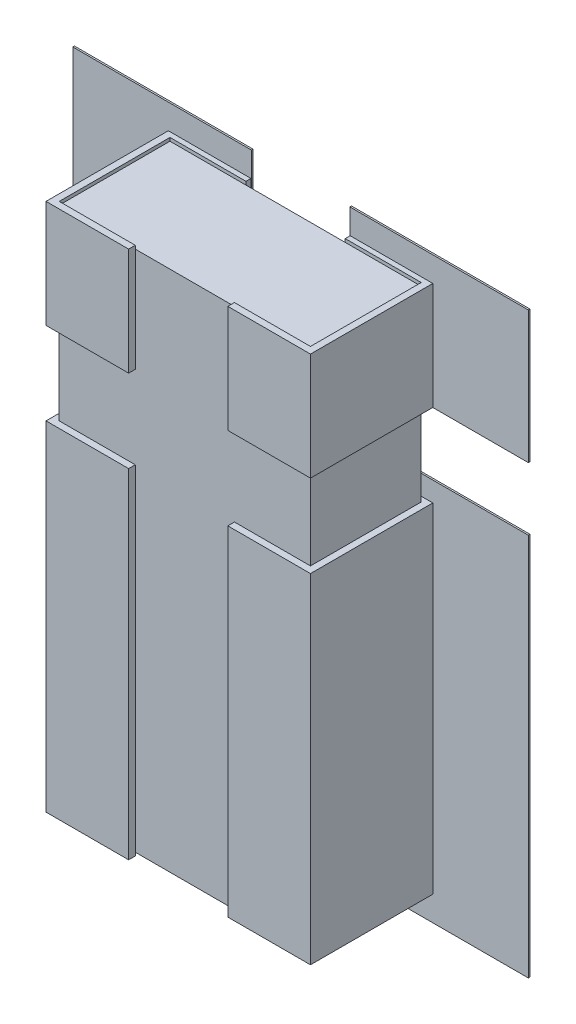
ISO-10303-21;
HEADER;
FILE_DESCRIPTION(('STEP AP214'),'2;1');
FILE_NAME('part.step','',(''),(''),'','','');
FILE_SCHEMA(('AUTOMOTIVE_DESIGN { 1 0 10303 214 1 1 1 1 }'));
ENDSEC;
DATA;
#1=APPLICATION_CONTEXT('core data for automotive mechanical design processes');
#2=APPLICATION_PROTOCOL_DEFINITION('international standard','automotive_design',2000,#1);
#3=PRODUCT_CONTEXT('',#1,'mechanical');
#4=PRODUCT('Part','Part','',(#3));
#5=PRODUCT_RELATED_PRODUCT_CATEGORY('part','',(#4));
#6=PRODUCT_DEFINITION_FORMATION('','',#4);
#7=PRODUCT_DEFINITION_CONTEXT('part definition',#1,'design');
#8=PRODUCT_DEFINITION('design','',#6,#7);
#9=PRODUCT_DEFINITION_SHAPE('','',#8);
#10=(LENGTH_UNIT() NAMED_UNIT(*) SI_UNIT(.MILLI.,.METRE.));
#11=(NAMED_UNIT(*) PLANE_ANGLE_UNIT() SI_UNIT($,.RADIAN.));
#12=(NAMED_UNIT(*) SI_UNIT($,.STERADIAN.) SOLID_ANGLE_UNIT());
#13=UNCERTAINTY_MEASURE_WITH_UNIT(LENGTH_MEASURE(1.E-05),#10,'distance_accuracy_value','');
#14=(GEOMETRIC_REPRESENTATION_CONTEXT(3) GLOBAL_UNCERTAINTY_ASSIGNED_CONTEXT((#13)) GLOBAL_UNIT_ASSIGNED_CONTEXT((#10,
#11,#12)) REPRESENTATION_CONTEXT('',''));
#15=CARTESIAN_POINT('',(0.,0.,0.));
#16=DIRECTION('',(0.,0.,1.));
#17=DIRECTION('',(1.,0.,0.));
#18=AXIS2_PLACEMENT_3D('',#15,#16,#17);
#19=CARTESIAN_POINT('',(-0.800000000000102,1.59999999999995,0.0762));
#20=DIRECTION('',(0.,0.,-1.));
#21=DIRECTION('',(-1.,0.,0.));
#22=AXIS2_PLACEMENT_3D('',#19,#20,#21);
#23=PLANE('',#22);
#24=DIRECTION('',(0.,1.,0.));
#25=VECTOR('',#24,1.);
#26=CARTESIAN_POINT('',(-1.37800000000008,0.570000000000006,0.0762));
#27=LINE('',#26,#25);
#28=CARTESIAN_POINT('',(-1.37800000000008,0.570000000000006,0.0762));
#29=VERTEX_POINT('',#28);
#30=CARTESIAN_POINT('',(-1.37800000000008,-1.75000000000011,0.0762));
#31=VERTEX_POINT('',#30);
#32=EDGE_CURVE('E666',#29,#31,#27,.F.);
#33=ORIENTED_EDGE('',*,*,#32,.F.);
#34=DIRECTION('',(-1.,0.,0.));
#35=VECTOR('',#34,1.);
#36=CARTESIAN_POINT('',(-0.800000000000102,0.570000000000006,0.0762));
#37=LINE('',#36,#35);
#38=CARTESIAN_POINT('',(-0.298000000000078,0.570000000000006,0.0762));
#39=VERTEX_POINT('',#38);
#40=EDGE_CURVE('E672',#29,#39,#37,.F.);
#41=ORIENTED_EDGE('',*,*,#40,.T.);
#42=DIRECTION('',(0.,1.,0.));
#43=VECTOR('',#42,1.);
#44=CARTESIAN_POINT('',(-0.298000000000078,-1.75000000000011,0.0762));
#45=LINE('',#44,#43);
#46=CARTESIAN_POINT('',(-0.298000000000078,-1.75000000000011,0.0762));
#47=VERTEX_POINT('',#46);
#48=EDGE_CURVE('E655',#47,#39,#45,.T.);
#49=ORIENTED_EDGE('',*,*,#48,.F.);
#50=DIRECTION('',(1.,0.,0.));
#51=VECTOR('',#50,1.);
#52=CARTESIAN_POINT('',(-1.37800000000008,-1.75000000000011,0.0762));
#53=LINE('',#52,#51);
#54=EDGE_CURVE('E661',#31,#47,#53,.T.);
#55=ORIENTED_EDGE('',*,*,#54,.F.);
#56=EDGE_LOOP('',(#33,#41,#49,#55));
#57=FACE_BOUND('',#56,.T.);
#58=ADVANCED_FACE('F16',(#57),#23,.T.);
#59=CARTESIAN_POINT('',(-0.30000000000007,1.59999999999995,0.826262));
#60=DIRECTION('',(0.,0.,1.));
#61=DIRECTION('',(1.,0.,0.));
#62=AXIS2_PLACEMENT_3D('',#59,#60,#61);
#63=PLANE('',#62);
#64=DIRECTION('',(0.,1.,0.));
#65=VECTOR('',#64,1.);
#66=CARTESIAN_POINT('',(-0.30000000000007,1.59999999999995,0.826262));
#67=LINE('',#66,#65);
#68=CARTESIAN_POINT('',(-0.30000000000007,0.449999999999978,0.826262));
#69=VERTEX_POINT('',#68);
#70=CARTESIAN_POINT('',(-0.30000000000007,-1.59999999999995,0.826262));
#71=VERTEX_POINT('',#70);
#72=EDGE_CURVE('E472',#69,#71,#67,.F.);
#73=ORIENTED_EDGE('',*,*,#72,.F.);
#74=DIRECTION('',(1.,0.,0.));
#75=VECTOR('',#74,1.);
#76=CARTESIAN_POINT('',(-0.30000000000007,0.449999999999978,0.826262));
#77=LINE('',#76,#75);
#78=CARTESIAN_POINT('',(-0.800000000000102,0.449999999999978,0.826262));
#79=VERTEX_POINT('',#78);
#80=EDGE_CURVE('E668',#69,#79,#77,.F.);
#81=ORIENTED_EDGE('',*,*,#80,.T.);
#82=DIRECTION('',(0.,1.,0.));
#83=VECTOR('',#82,1.);
#84=CARTESIAN_POINT('',(-0.800000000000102,1.59999999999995,0.826262));
#85=LINE('',#84,#83);
#86=CARTESIAN_POINT('',(-0.800000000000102,-1.59999999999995,0.826262));
#87=VERTEX_POINT('',#86);
#88=EDGE_CURVE('E646',#87,#79,#85,.T.);
#89=ORIENTED_EDGE('',*,*,#88,.F.);
#90=DIRECTION('',(1.,0.,0.));
#91=VECTOR('',#90,1.);
#92=CARTESIAN_POINT('',(-0.30000000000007,-1.59999999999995,0.826262));
#93=LINE('',#92,#91);
#94=EDGE_CURVE('E670',#87,#71,#93,.T.);
#95=ORIENTED_EDGE('',*,*,#94,.T.);
#96=EDGE_LOOP('',(#73,#81,#89,#95));
#97=FACE_BOUND('',#96,.T.);
#98=ADVANCED_FACE('F1356',(#97),#63,.T.);
#99=CARTESIAN_POINT('',(-1.37800000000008,0.570000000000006,0.0762));
#100=DIRECTION('',(-1.,0.,0.));
#101=DIRECTION('',(0.,0.,1.));
#102=AXIS2_PLACEMENT_3D('',#99,#100,#101);
#103=PLANE('',#102);
#104=DIRECTION('',(0.,0.,1.));
#105=VECTOR('',#104,1.);
#106=CARTESIAN_POINT('',(-1.37800000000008,0.570000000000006,0.0762));
#107=LINE('',#106,#105);
#108=CARTESIAN_POINT('',(-1.37800000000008,0.570000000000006,0.0862000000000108));
#109=VERTEX_POINT('',#108);
#110=EDGE_CURVE('E652',#29,#109,#107,.T.);
#111=ORIENTED_EDGE('',*,*,#110,.F.);
#112=ORIENTED_EDGE('',*,*,#32,.T.);
#113=DIRECTION('',(0.,0.,-1.));
#114=VECTOR('',#113,1.);
#115=CARTESIAN_POINT('',(-1.37800000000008,-1.75000000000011,0.0762));
#116=LINE('',#115,#114);
#117=CARTESIAN_POINT('',(-1.37800000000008,-1.75000000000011,0.0862000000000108));
#118=VERTEX_POINT('',#117);
#119=EDGE_CURVE('E663',#118,#31,#116,.T.);
#120=ORIENTED_EDGE('',*,*,#119,.F.);
#121=DIRECTION('',(0.,1.,0.));
#122=VECTOR('',#121,1.);
#123=CARTESIAN_POINT('',(-1.37800000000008,0.,0.0862000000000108));
#124=LINE('',#123,#122);
#125=EDGE_CURVE('E463',#109,#118,#124,.F.);
#126=ORIENTED_EDGE('',*,*,#125,.F.);
#127=EDGE_LOOP('',(#111,#112,#120,#126));
#128=FACE_BOUND('',#127,.T.);
#129=ADVANCED_FACE('F1391',(#128),#103,.T.);
#130=CARTESIAN_POINT('',(-1.37800000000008,-1.75000000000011,0.0762));
#131=DIRECTION('',(0.,-1.,0.));
#132=DIRECTION('',(0.,0.,-1.));
#133=AXIS2_PLACEMENT_3D('',#130,#131,#132);
#134=PLANE('',#133);
#135=ORIENTED_EDGE('',*,*,#119,.T.);
#136=ORIENTED_EDGE('',*,*,#54,.T.);
#137=DIRECTION('',(0.,0.,-1.));
#138=VECTOR('',#137,1.);
#139=CARTESIAN_POINT('',(-0.298000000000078,-1.75000000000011,0.0762));
#140=LINE('',#139,#138);
#141=CARTESIAN_POINT('',(-0.298000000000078,-1.75000000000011,0.0862000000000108));
#142=VERTEX_POINT('',#141);
#143=EDGE_CURVE('E658',#142,#47,#140,.T.);
#144=ORIENTED_EDGE('',*,*,#143,.F.);
#145=DIRECTION('',(1.,0.,0.));
#146=VECTOR('',#145,1.);
#147=CARTESIAN_POINT('',(0.,-1.75000000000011,0.0862000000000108));
#148=LINE('',#147,#146);
#149=EDGE_CURVE('E460',#118,#142,#148,.T.);
#150=ORIENTED_EDGE('',*,*,#149,.F.);
#151=EDGE_LOOP('',(#135,#136,#144,#150));
#152=FACE_BOUND('',#151,.T.);
#153=ADVANCED_FACE('F1400',(#152),#134,.T.);
#154=CARTESIAN_POINT('',(-0.298000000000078,-1.75000000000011,0.0762));
#155=DIRECTION('',(1.,0.,0.));
#156=DIRECTION('',(0.,0.,-1.));
#157=AXIS2_PLACEMENT_3D('',#154,#155,#156);
#158=PLANE('',#157);
#159=ORIENTED_EDGE('',*,*,#143,.T.);
#160=ORIENTED_EDGE('',*,*,#48,.T.);
#161=DIRECTION('',(0.,0.,1.));
#162=VECTOR('',#161,1.);
#163=CARTESIAN_POINT('',(-0.298000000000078,0.570000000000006,0.0762));
#164=LINE('',#163,#162);
#165=CARTESIAN_POINT('',(-0.298000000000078,0.570000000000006,0.0862000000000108));
#166=VERTEX_POINT('',#165);
#167=EDGE_CURVE('E649',#166,#39,#164,.F.);
#168=ORIENTED_EDGE('',*,*,#167,.F.);
#169=DIRECTION('',(0.,1.,0.));
#170=VECTOR('',#169,1.);
#171=CARTESIAN_POINT('',(-0.298000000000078,0.,0.0862000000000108));
#172=LINE('',#171,#170);
#173=EDGE_CURVE('E457',#142,#166,#172,.T.);
#174=ORIENTED_EDGE('',*,*,#173,.F.);
#175=EDGE_LOOP('',(#159,#160,#168,#174));
#176=FACE_BOUND('',#175,.T.);
#177=ADVANCED_FACE('F1410',(#176),#158,.T.);
#178=CARTESIAN_POINT('',(-0.298000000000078,0.570000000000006,0.0762));
#179=DIRECTION('',(0.,1.,0.));
#180=DIRECTION('',(0.,0.,1.));
#181=AXIS2_PLACEMENT_3D('',#178,#179,#180);
#182=PLANE('',#181);
#183=ORIENTED_EDGE('',*,*,#167,.T.);
#184=ORIENTED_EDGE('',*,*,#40,.F.);
#185=ORIENTED_EDGE('',*,*,#110,.T.);
#186=DIRECTION('',(1.,0.,0.));
#187=VECTOR('',#186,1.);
#188=CARTESIAN_POINT('',(0.,0.570000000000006,0.0862000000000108));
#189=LINE('',#188,#187);
#190=EDGE_CURVE('E454',#166,#109,#189,.F.);
#191=ORIENTED_EDGE('',*,*,#190,.F.);
#192=EDGE_LOOP('',(#183,#184,#185,#191));
#193=FACE_BOUND('',#192,.T.);
#194=ADVANCED_FACE('F1420',(#193),#182,.T.);
#195=CARTESIAN_POINT('',(-0.800000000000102,1.59999999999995,0.826262));
#196=DIRECTION('',(-1.,0.,0.));
#197=DIRECTION('',(0.,0.,1.));
#198=AXIS2_PLACEMENT_3D('',#195,#196,#197);
#199=PLANE('',#198);
#200=DIRECTION('',(0.,0.,1.));
#201=VECTOR('',#200,1.);
#202=CARTESIAN_POINT('',(-0.800000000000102,0.449999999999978,0.826262));
#203=LINE('',#202,#201);
#204=CARTESIAN_POINT('',(-0.800000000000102,0.449999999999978,0.0862000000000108));
#205=VERTEX_POINT('',#204);
#206=EDGE_CURVE('E480',#79,#205,#203,.F.);
#207=ORIENTED_EDGE('',*,*,#206,.T.);
#208=DIRECTION('',(0.,1.,0.));
#209=VECTOR('',#208,1.);
#210=CARTESIAN_POINT('',(-0.800000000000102,0.,0.0862000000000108));
#211=LINE('',#210,#209);
#212=CARTESIAN_POINT('',(-0.800000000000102,-1.59999999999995,0.0862000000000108));
#213=VERTEX_POINT('',#212);
#214=EDGE_CURVE('E451',#213,#205,#211,.T.);
#215=ORIENTED_EDGE('',*,*,#214,.F.);
#216=DIRECTION('',(0.,0.,-1.));
#217=VECTOR('',#216,1.);
#218=CARTESIAN_POINT('',(-0.800000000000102,-1.59999999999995,0.));
#219=LINE('',#218,#217);
#220=EDGE_CURVE('E466',#87,#213,#219,.T.);
#221=ORIENTED_EDGE('',*,*,#220,.F.);
#222=ORIENTED_EDGE('',*,*,#88,.T.);
#223=EDGE_LOOP('',(#207,#215,#221,#222));
#224=FACE_BOUND('',#223,.T.);
#225=ADVANCED_FACE('F1430',(#224),#199,.T.);
#226=CARTESIAN_POINT('',(-0.298000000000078,1.75000000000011,0.0762));
#227=DIRECTION('',(0.,1.,0.));
#228=DIRECTION('',(0.,0.,1.));
#229=AXIS2_PLACEMENT_3D('',#226,#227,#228);
#230=PLANE('',#229);
#231=DIRECTION('',(0.,0.,-1.));
#232=VECTOR('',#231,1.);
#233=CARTESIAN_POINT('',(-0.298000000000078,1.75000000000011,0.0762));
#234=LINE('',#233,#232);
#235=CARTESIAN_POINT('',(-0.298000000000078,1.75000000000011,0.0762));
#236=VERTEX_POINT('',#235);
#237=CARTESIAN_POINT('',(-0.298000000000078,1.75000000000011,0.0862000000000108));
#238=VERTEX_POINT('',#237);
#239=EDGE_CURVE('E448',#236,#238,#234,.F.);
#240=ORIENTED_EDGE('',*,*,#239,.F.);
#241=DIRECTION('',(-1.,0.,0.));
#242=VECTOR('',#241,1.);
#243=CARTESIAN_POINT('',(-0.800000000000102,1.75000000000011,0.0762));
#244=LINE('',#243,#242);
#245=CARTESIAN_POINT('',(-1.37800000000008,1.75000000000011,0.0762));
#246=VERTEX_POINT('',#245);
#247=EDGE_CURVE('E437',#246,#236,#244,.F.);
#248=ORIENTED_EDGE('',*,*,#247,.F.);
#249=DIRECTION('',(0.,0.,1.));
#250=VECTOR('',#249,1.);
#251=CARTESIAN_POINT('',(-1.37800000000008,1.75000000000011,0.0762));
#252=LINE('',#251,#250);
#253=CARTESIAN_POINT('',(-1.37800000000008,1.75000000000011,0.0862000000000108));
#254=VERTEX_POINT('',#253);
#255=EDGE_CURVE('E436',#254,#246,#252,.F.);
#256=ORIENTED_EDGE('',*,*,#255,.F.);
#257=DIRECTION('',(1.,0.,0.));
#258=VECTOR('',#257,1.);
#259=CARTESIAN_POINT('',(0.,1.75000000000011,0.0862000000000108));
#260=LINE('',#259,#258);
#261=EDGE_CURVE('E606',#238,#254,#260,.F.);
#262=ORIENTED_EDGE('',*,*,#261,.F.);
#263=EDGE_LOOP('',(#240,#248,#256,#262));
#264=FACE_BOUND('',#263,.T.);
#265=ADVANCED_FACE('F850',(#264),#230,.T.);
#266=CARTESIAN_POINT('',(1.37800000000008,1.75000000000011,0.0762));
#267=DIRECTION('',(0.,1.,0.));
#268=DIRECTION('',(0.,0.,1.));
#269=AXIS2_PLACEMENT_3D('',#266,#267,#268);
#270=PLANE('',#269);
#271=DIRECTION('',(0.,0.,-1.));
#272=VECTOR('',#271,1.);
#273=CARTESIAN_POINT('',(1.37800000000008,1.75000000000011,0.0762));
#274=LINE('',#273,#272);
#275=CARTESIAN_POINT('',(1.37800000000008,1.75000000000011,0.0762));
#276=VERTEX_POINT('',#275);
#277=CARTESIAN_POINT('',(1.37800000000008,1.75000000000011,0.0862000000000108));
#278=VERTEX_POINT('',#277);
#279=EDGE_CURVE('E483',#276,#278,#274,.F.);
#280=ORIENTED_EDGE('',*,*,#279,.F.);
#281=DIRECTION('',(-1.,0.,0.));
#282=VECTOR('',#281,1.);
#283=CARTESIAN_POINT('',(-0.800000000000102,1.75000000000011,0.0762));
#284=LINE('',#283,#282);
#285=CARTESIAN_POINT('',(0.298000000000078,1.75000000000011,0.0762));
#286=VERTEX_POINT('',#285);
#287=EDGE_CURVE('E509',#286,#276,#284,.F.);
#288=ORIENTED_EDGE('',*,*,#287,.F.);
#289=DIRECTION('',(0.,0.,1.));
#290=VECTOR('',#289,1.);
#291=CARTESIAN_POINT('',(0.298000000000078,1.75000000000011,0.0762));
#292=LINE('',#291,#290);
#293=CARTESIAN_POINT('',(0.298000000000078,1.75000000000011,0.0862000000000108));
#294=VERTEX_POINT('',#293);
#295=EDGE_CURVE('E494',#294,#286,#292,.F.);
#296=ORIENTED_EDGE('',*,*,#295,.F.);
#297=DIRECTION('',(1.,0.,0.));
#298=VECTOR('',#297,1.);
#299=CARTESIAN_POINT('',(0.,1.75000000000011,0.0862000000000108));
#300=LINE('',#299,#298);
#301=EDGE_CURVE('E501',#278,#294,#300,.F.);
#302=ORIENTED_EDGE('',*,*,#301,.F.);
#303=EDGE_LOOP('',(#280,#288,#296,#302));
#304=FACE_BOUND('',#303,.T.);
#305=ADVANCED_FACE('F1449',(#304),#270,.T.);
#306=CARTESIAN_POINT('',(-0.30000000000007,1.59999999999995,0.786261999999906));
#307=DIRECTION('',(1.,0.,0.));
#308=DIRECTION('',(0.,0.,-1.));
#309=AXIS2_PLACEMENT_3D('',#306,#307,#308);
#310=PLANE('',#309);
#311=ORIENTED_EDGE('',*,*,#72,.T.);
#312=DIRECTION('',(0.,0.,-1.));
#313=VECTOR('',#312,1.);
#314=CARTESIAN_POINT('',(-0.30000000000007,-1.59999999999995,0.));
#315=LINE('',#314,#313);
#316=CARTESIAN_POINT('',(-0.30000000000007,-1.59999999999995,0.786261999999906));
#317=VERTEX_POINT('',#316);
#318=EDGE_CURVE('E469',#317,#71,#315,.F.);
#319=ORIENTED_EDGE('',*,*,#318,.F.);
#320=DIRECTION('',(0.,1.,0.));
#321=VECTOR('',#320,1.);
#322=CARTESIAN_POINT('',(-0.30000000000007,1.59999999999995,0.786261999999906));
#323=LINE('',#322,#321);
#324=CARTESIAN_POINT('',(-0.30000000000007,-1.58000000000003,0.786261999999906));
#325=VERTEX_POINT('',#324);
#326=EDGE_CURVE('E478',#317,#325,#323,.T.);
#327=ORIENTED_EDGE('',*,*,#326,.T.);
#328=DIRECTION('',(0.,1.,0.));
#329=VECTOR('',#328,1.);
#330=CARTESIAN_POINT('',(-0.30000000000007,1.59999999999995,0.786261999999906));
#331=LINE('',#330,#329);
#332=CARTESIAN_POINT('',(-0.30000000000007,0.449999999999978,0.786261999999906));
#333=VERTEX_POINT('',#332);
#334=EDGE_CURVE('E744',#333,#325,#331,.F.);
#335=ORIENTED_EDGE('',*,*,#334,.F.);
#336=DIRECTION('',(0.,0.,-1.));
#337=VECTOR('',#336,1.);
#338=CARTESIAN_POINT('',(-0.30000000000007,0.449999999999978,0.786261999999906));
#339=LINE('',#338,#337);
#340=EDGE_CURVE('E475',#333,#69,#339,.F.);
#341=ORIENTED_EDGE('',*,*,#340,.T.);
#342=EDGE_LOOP('',(#311,#319,#327,#335,#341));
#343=FACE_BOUND('',#342,.T.);
#344=ADVANCED_FACE('F899',(#343),#310,.T.);
#345=CARTESIAN_POINT('',(0.,-1.59999999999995,0.));
#346=DIRECTION('',(0.,-1.,0.));
#347=DIRECTION('',(0.,0.,-1.));
#348=AXIS2_PLACEMENT_3D('',#345,#346,#347);
#349=PLANE('',#348);
#350=ORIENTED_EDGE('',*,*,#220,.T.);
#351=DIRECTION('',(1.,0.,0.));
#352=VECTOR('',#351,1.);
#353=CARTESIAN_POINT('',(0.,-1.59999999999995,0.0862000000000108));
#354=LINE('',#353,#352);
#355=CARTESIAN_POINT('',(-0.30000000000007,-1.59999999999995,0.0862000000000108));
#356=VERTEX_POINT('',#355);
#357=EDGE_CURVE('E445',#356,#213,#354,.F.);
#358=ORIENTED_EDGE('',*,*,#357,.F.);
#359=DIRECTION('',(0.,0.,-1.));
#360=VECTOR('',#359,1.);
#361=CARTESIAN_POINT('',(-0.30000000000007,-1.59999999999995,0.0762));
#362=LINE('',#361,#360);
#363=CARTESIAN_POINT('',(-0.30000000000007,-1.59999999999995,0.116199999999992));
#364=VERTEX_POINT('',#363);
#365=EDGE_CURVE('E717',#364,#356,#362,.T.);
#366=ORIENTED_EDGE('',*,*,#365,.F.);
#367=DIRECTION('',(-1.,0.,0.));
#368=VECTOR('',#367,1.);
#369=CARTESIAN_POINT('',(0.760000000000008,-1.59999999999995,0.116199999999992));
#370=LINE('',#369,#368);
#371=CARTESIAN_POINT('',(-0.760000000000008,-1.59999999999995,0.116199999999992));
#372=VERTEX_POINT('',#371);
#373=EDGE_CURVE('E735',#364,#372,#370,.T.);
#374=ORIENTED_EDGE('',*,*,#373,.T.);
#375=DIRECTION('',(0.,0.,-1.));
#376=VECTOR('',#375,1.);
#377=CARTESIAN_POINT('',(-0.760000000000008,-1.59999999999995,0.));
#378=LINE('',#377,#376);
#379=CARTESIAN_POINT('',(-0.760000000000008,-1.59999999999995,0.786261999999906));
#380=VERTEX_POINT('',#379);
#381=EDGE_CURVE('E729',#380,#372,#378,.T.);
#382=ORIENTED_EDGE('',*,*,#381,.F.);
#383=DIRECTION('',(1.,0.,0.));
#384=VECTOR('',#383,1.);
#385=CARTESIAN_POINT('',(0.760000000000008,-1.59999999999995,0.786261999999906));
#386=LINE('',#385,#384);
#387=EDGE_CURVE('E726',#380,#317,#386,.T.);
#388=ORIENTED_EDGE('',*,*,#387,.T.);
#389=ORIENTED_EDGE('',*,*,#318,.T.);
#390=ORIENTED_EDGE('',*,*,#94,.F.);
#391=EDGE_LOOP('',(#350,#358,#366,#374,#382,#388,#389,#390));
#392=FACE_BOUND('',#391,.T.);
#393=ADVANCED_FACE('F1343',(#392),#349,.T.);
#394=CARTESIAN_POINT('',(0.,0.,0.0862000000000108));
#395=DIRECTION('',(0.,0.,1.));
#396=DIRECTION('',(1.,0.,0.));
#397=AXIS2_PLACEMENT_3D('',#394,#395,#396);
#398=PLANE('',#397);
#399=DIRECTION('',(0.,1.,0.));
#400=VECTOR('',#399,1.);
#401=CARTESIAN_POINT('',(-0.30000000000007,1.59999999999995,0.0862000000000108));
#402=LINE('',#401,#400);
#403=CARTESIAN_POINT('',(-0.30000000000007,0.449999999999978,0.0862000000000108));
#404=VERTEX_POINT('',#403);
#405=EDGE_CURVE('E714',#356,#404,#402,.T.);
#406=ORIENTED_EDGE('',*,*,#405,.F.);
#407=ORIENTED_EDGE('',*,*,#357,.T.);
#408=ORIENTED_EDGE('',*,*,#214,.T.);
#409=DIRECTION('',(1.,0.,0.));
#410=VECTOR('',#409,1.);
#411=CARTESIAN_POINT('',(0.,0.449999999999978,0.0862000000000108));
#412=LINE('',#411,#410);
#413=EDGE_CURVE('E449',#205,#404,#412,.T.);
#414=ORIENTED_EDGE('',*,*,#413,.T.);
#415=EDGE_LOOP('',(#406,#407,#408,#414));
#416=FACE_BOUND('',#415,.T.);
#417=ORIENTED_EDGE('',*,*,#173,.T.);
#418=ORIENTED_EDGE('',*,*,#190,.T.);
#419=ORIENTED_EDGE('',*,*,#125,.T.);
#420=ORIENTED_EDGE('',*,*,#149,.T.);
#421=EDGE_LOOP('',(#417,#418,#419,#420));
#422=FACE_BOUND('',#421,.T.);
#423=ADVANCED_FACE('F1337',(#416,#422),#398,.T.);
#424=CARTESIAN_POINT('',(-0.298000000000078,0.95000000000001,0.0762));
#425=DIRECTION('',(1.,0.,0.));
#426=DIRECTION('',(0.,0.,-1.));
#427=AXIS2_PLACEMENT_3D('',#424,#425,#426);
#428=PLANE('',#427);
#429=DIRECTION('',(0.,0.,1.));
#430=VECTOR('',#429,1.);
#431=CARTESIAN_POINT('',(-0.298000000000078,0.95000000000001,0.786261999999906));
#432=LINE('',#431,#430);
#433=CARTESIAN_POINT('',(-0.298000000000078,0.95000000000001,0.0862000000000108));
#434=VERTEX_POINT('',#433);
#435=CARTESIAN_POINT('',(-0.298000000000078,0.95000000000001,0.0762));
#436=VERTEX_POINT('',#435);
#437=EDGE_CURVE('E375',#434,#436,#432,.F.);
#438=ORIENTED_EDGE('',*,*,#437,.T.);
#439=DIRECTION('',(0.,1.,0.));
#440=VECTOR('',#439,1.);
#441=CARTESIAN_POINT('',(-0.298000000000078,1.59999999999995,0.0762));
#442=LINE('',#441,#440);
#443=EDGE_CURVE('E433',#236,#436,#442,.F.);
#444=ORIENTED_EDGE('',*,*,#443,.F.);
#445=ORIENTED_EDGE('',*,*,#239,.T.);
#446=DIRECTION('',(0.,1.,0.));
#447=VECTOR('',#446,1.);
#448=CARTESIAN_POINT('',(-0.298000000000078,0.,0.0862000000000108));
#449=LINE('',#448,#447);
#450=EDGE_CURVE('E586',#434,#238,#449,.T.);
#451=ORIENTED_EDGE('',*,*,#450,.F.);
#452=EDGE_LOOP('',(#438,#444,#445,#451));
#453=FACE_BOUND('',#452,.T.);
#454=ADVANCED_FACE('F847',(#453),#428,.T.);
#455=CARTESIAN_POINT('',(-0.800000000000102,1.59999999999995,0.0762));
#456=DIRECTION('',(0.,0.,-1.));
#457=DIRECTION('',(-1.,0.,0.));
#458=AXIS2_PLACEMENT_3D('',#455,#456,#457);
#459=PLANE('',#458);
#460=ORIENTED_EDGE('',*,*,#443,.T.);
#461=DIRECTION('',(1.,0.,0.));
#462=VECTOR('',#461,1.);
#463=CARTESIAN_POINT('',(0.760000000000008,0.95000000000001,0.0762));
#464=LINE('',#463,#462);
#465=CARTESIAN_POINT('',(-1.37800000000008,0.95000000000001,0.0762));
#466=VERTEX_POINT('',#465);
#467=EDGE_CURVE('E440',#436,#466,#464,.F.);
#468=ORIENTED_EDGE('',*,*,#467,.T.);
#469=DIRECTION('',(0.,1.,0.));
#470=VECTOR('',#469,1.);
#471=CARTESIAN_POINT('',(-1.37800000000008,1.75000000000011,0.0762));
#472=LINE('',#471,#470);
#473=EDGE_CURVE('E618',#246,#466,#472,.F.);
#474=ORIENTED_EDGE('',*,*,#473,.F.);
#475=ORIENTED_EDGE('',*,*,#247,.T.);
#476=EDGE_LOOP('',(#460,#468,#474,#475));
#477=FACE_BOUND('',#476,.T.);
#478=ADVANCED_FACE('F1322',(#477),#459,.T.);
#479=CARTESIAN_POINT('',(-1.37800000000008,1.75000000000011,0.0762));
#480=DIRECTION('',(-1.,0.,0.));
#481=DIRECTION('',(0.,0.,1.));
#482=AXIS2_PLACEMENT_3D('',#479,#480,#481);
#483=PLANE('',#482);
#484=ORIENTED_EDGE('',*,*,#255,.T.);
#485=ORIENTED_EDGE('',*,*,#473,.T.);
#486=DIRECTION('',(0.,0.,1.));
#487=VECTOR('',#486,1.);
#488=CARTESIAN_POINT('',(-1.37800000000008,0.95000000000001,0.786261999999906));
#489=LINE('',#488,#487);
#490=CARTESIAN_POINT('',(-1.37800000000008,0.95000000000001,0.0862000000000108));
#491=VERTEX_POINT('',#490);
#492=EDGE_CURVE('E442',#466,#491,#489,.T.);
#493=ORIENTED_EDGE('',*,*,#492,.T.);
#494=DIRECTION('',(0.,1.,0.));
#495=VECTOR('',#494,1.);
#496=CARTESIAN_POINT('',(-1.37800000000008,0.,0.0862000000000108));
#497=LINE('',#496,#495);
#498=EDGE_CURVE('E590',#254,#491,#497,.F.);
#499=ORIENTED_EDGE('',*,*,#498,.F.);
#500=EDGE_LOOP('',(#484,#485,#493,#499));
#501=FACE_BOUND('',#500,.T.);
#502=ADVANCED_FACE('F854',(#501),#483,.T.);
#503=CARTESIAN_POINT('',(-0.800000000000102,1.59999999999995,0.826262));
#504=DIRECTION('',(-1.,0.,0.));
#505=DIRECTION('',(0.,0.,1.));
#506=AXIS2_PLACEMENT_3D('',#503,#504,#505);
#507=PLANE('',#506);
#508=DIRECTION('',(0.,0.,-1.));
#509=VECTOR('',#508,1.);
#510=CARTESIAN_POINT('',(-0.800000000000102,1.59999999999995,0.));
#511=LINE('',#510,#509);
#512=CARTESIAN_POINT('',(-0.800000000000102,1.59999999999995,0.826262));
#513=VERTEX_POINT('',#512);
#514=CARTESIAN_POINT('',(-0.800000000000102,1.59999999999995,0.0862000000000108));
#515=VERTEX_POINT('',#514);
#516=EDGE_CURVE('E584',#513,#515,#511,.T.);
#517=ORIENTED_EDGE('',*,*,#516,.T.);
#518=DIRECTION('',(0.,1.,0.));
#519=VECTOR('',#518,1.);
#520=CARTESIAN_POINT('',(-0.800000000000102,0.,0.0862000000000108));
#521=LINE('',#520,#519);
#522=CARTESIAN_POINT('',(-0.800000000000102,0.95000000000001,0.0862000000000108));
#523=VERTEX_POINT('',#522);
#524=EDGE_CURVE('E409',#523,#515,#521,.T.);
#525=ORIENTED_EDGE('',*,*,#524,.F.);
#526=DIRECTION('',(0.,0.,1.));
#527=VECTOR('',#526,1.);
#528=CARTESIAN_POINT('',(-0.800000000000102,0.95000000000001,0.786261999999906));
#529=LINE('',#528,#527);
#530=CARTESIAN_POINT('',(-0.800000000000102,0.95000000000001,0.826262));
#531=VERTEX_POINT('',#530);
#532=EDGE_CURVE('E596',#523,#531,#529,.T.);
#533=ORIENTED_EDGE('',*,*,#532,.T.);
#534=DIRECTION('',(0.,1.,0.));
#535=VECTOR('',#534,1.);
#536=CARTESIAN_POINT('',(-0.800000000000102,1.59999999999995,0.826262));
#537=LINE('',#536,#535);
#538=EDGE_CURVE('E615',#513,#531,#537,.F.);
#539=ORIENTED_EDGE('',*,*,#538,.F.);
#540=EDGE_LOOP('',(#517,#525,#533,#539));
#541=FACE_BOUND('',#540,.T.);
#542=ADVANCED_FACE('F861',(#541),#507,.T.);
#543=CARTESIAN_POINT('',(-0.30000000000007,1.59999999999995,0.826262));
#544=DIRECTION('',(0.,0.,1.));
#545=DIRECTION('',(1.,0.,0.));
#546=AXIS2_PLACEMENT_3D('',#543,#544,#545);
#547=PLANE('',#546);
#548=ORIENTED_EDGE('',*,*,#538,.T.);
#549=DIRECTION('',(1.,0.,0.));
#550=VECTOR('',#549,1.);
#551=CARTESIAN_POINT('',(0.760000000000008,0.95000000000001,0.826262));
#552=LINE('',#551,#550);
#553=CARTESIAN_POINT('',(-0.30000000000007,0.95000000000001,0.826262));
#554=VERTEX_POINT('',#553);
#555=EDGE_CURVE('E600',#531,#554,#552,.T.);
#556=ORIENTED_EDGE('',*,*,#555,.T.);
#557=DIRECTION('',(0.,1.,0.));
#558=VECTOR('',#557,1.);
#559=CARTESIAN_POINT('',(-0.30000000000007,1.59999999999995,0.826262));
#560=LINE('',#559,#558);
#561=CARTESIAN_POINT('',(-0.30000000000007,1.59999999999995,0.826262));
#562=VERTEX_POINT('',#561);
#563=EDGE_CURVE('E571',#562,#554,#560,.F.);
#564=ORIENTED_EDGE('',*,*,#563,.F.);
#565=DIRECTION('',(1.,0.,0.));
#566=VECTOR('',#565,1.);
#567=CARTESIAN_POINT('',(0.,1.59999999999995,0.826262));
#568=LINE('',#567,#566);
#569=EDGE_CURVE('E570',#562,#513,#568,.F.);
#570=ORIENTED_EDGE('',*,*,#569,.T.);
#571=EDGE_LOOP('',(#548,#556,#564,#570));
#572=FACE_BOUND('',#571,.T.);
#573=ADVANCED_FACE('F863',(#572),#547,.T.);
#574=CARTESIAN_POINT('',(-0.30000000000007,1.59999999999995,0.786261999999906));
#575=DIRECTION('',(1.,0.,0.));
#576=DIRECTION('',(0.,0.,-1.));
#577=AXIS2_PLACEMENT_3D('',#574,#575,#576);
#578=PLANE('',#577);
#579=DIRECTION('',(0.,0.,1.));
#580=VECTOR('',#579,1.);
#581=CARTESIAN_POINT('',(-0.30000000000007,0.95000000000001,0.786261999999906));
#582=LINE('',#581,#580);
#583=CARTESIAN_POINT('',(-0.30000000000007,0.95000000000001,0.786261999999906));
#584=VERTEX_POINT('',#583);
#585=EDGE_CURVE('E626',#554,#584,#582,.F.);
#586=ORIENTED_EDGE('',*,*,#585,.T.);
#587=DIRECTION('',(0.,1.,0.));
#588=VECTOR('',#587,1.);
#589=CARTESIAN_POINT('',(-0.30000000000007,1.59999999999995,0.786261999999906));
#590=LINE('',#589,#588);
#591=CARTESIAN_POINT('',(-0.30000000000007,1.58000000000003,0.786261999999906));
#592=VERTEX_POINT('',#591);
#593=EDGE_CURVE('E747',#592,#584,#590,.F.);
#594=ORIENTED_EDGE('',*,*,#593,.F.);
#595=DIRECTION('',(0.,1.,0.));
#596=VECTOR('',#595,1.);
#597=CARTESIAN_POINT('',(-0.30000000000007,1.59999999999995,0.786261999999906));
#598=LINE('',#597,#596);
#599=CARTESIAN_POINT('',(-0.30000000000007,1.59999999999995,0.786261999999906));
#600=VERTEX_POINT('',#599);
#601=EDGE_CURVE('E551',#592,#600,#598,.T.);
#602=ORIENTED_EDGE('',*,*,#601,.T.);
#603=DIRECTION('',(0.,0.,-1.));
#604=VECTOR('',#603,1.);
#605=CARTESIAN_POINT('',(-0.30000000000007,1.59999999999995,0.));
#606=LINE('',#605,#604);
#607=EDGE_CURVE('E567',#600,#562,#606,.F.);
#608=ORIENTED_EDGE('',*,*,#607,.T.);
#609=ORIENTED_EDGE('',*,*,#563,.T.);
#610=EDGE_LOOP('',(#586,#594,#602,#608,#609));
#611=FACE_BOUND('',#610,.T.);
#612=ADVANCED_FACE('F969',(#611),#578,.T.);
#613=CARTESIAN_POINT('',(0.,1.59999999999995,0.));
#614=DIRECTION('',(0.,-1.,0.));
#615=DIRECTION('',(0.,0.,-1.));
#616=AXIS2_PLACEMENT_3D('',#613,#614,#615);
#617=PLANE('',#616);
#618=ORIENTED_EDGE('',*,*,#569,.F.);
#619=ORIENTED_EDGE('',*,*,#607,.F.);
#620=DIRECTION('',(1.,0.,0.));
#621=VECTOR('',#620,1.);
#622=CARTESIAN_POINT('',(0.760000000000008,1.59999999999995,0.786261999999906));
#623=LINE('',#622,#621);
#624=CARTESIAN_POINT('',(-0.760000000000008,1.59999999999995,0.786261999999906));
#625=VERTEX_POINT('',#624);
#626=EDGE_CURVE('E527',#600,#625,#623,.F.);
#627=ORIENTED_EDGE('',*,*,#626,.T.);
#628=DIRECTION('',(0.,0.,-1.));
#629=VECTOR('',#628,1.);
#630=CARTESIAN_POINT('',(-0.760000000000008,1.59999999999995,0.));
#631=LINE('',#630,#629);
#632=CARTESIAN_POINT('',(-0.760000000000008,1.59999999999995,0.116199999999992));
#633=VERTEX_POINT('',#632);
#634=EDGE_CURVE('E430',#633,#625,#631,.F.);
#635=ORIENTED_EDGE('',*,*,#634,.F.);
#636=DIRECTION('',(-1.,0.,0.));
#637=VECTOR('',#636,1.);
#638=CARTESIAN_POINT('',(0.760000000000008,1.59999999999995,0.116199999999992));
#639=LINE('',#638,#637);
#640=CARTESIAN_POINT('',(-0.30000000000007,1.59999999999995,0.116199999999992));
#641=VERTEX_POINT('',#640);
#642=EDGE_CURVE('E427',#633,#641,#639,.F.);
#643=ORIENTED_EDGE('',*,*,#642,.T.);
#644=DIRECTION('',(0.,0.,-1.));
#645=VECTOR('',#644,1.);
#646=CARTESIAN_POINT('',(-0.30000000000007,1.59999999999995,0.0762));
#647=LINE('',#646,#645);
#648=CARTESIAN_POINT('',(-0.30000000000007,1.59999999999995,0.0862000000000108));
#649=VERTEX_POINT('',#648);
#650=EDGE_CURVE('E397',#649,#641,#647,.F.);
#651=ORIENTED_EDGE('',*,*,#650,.F.);
#652=DIRECTION('',(1.,0.,0.));
#653=VECTOR('',#652,1.);
#654=CARTESIAN_POINT('',(0.,1.59999999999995,0.0862000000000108));
#655=LINE('',#654,#653);
#656=EDGE_CURVE('E385',#515,#649,#655,.T.);
#657=ORIENTED_EDGE('',*,*,#656,.F.);
#658=ORIENTED_EDGE('',*,*,#516,.F.);
#659=EDGE_LOOP('',(#618,#619,#627,#635,#643,#651,#657,#658));
#660=FACE_BOUND('',#659,.T.);
#661=ADVANCED_FACE('F867',(#660),#617,.F.);
#662=CARTESIAN_POINT('',(0.,0.,0.0862000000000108));
#663=DIRECTION('',(0.,0.,1.));
#664=DIRECTION('',(1.,0.,0.));
#665=AXIS2_PLACEMENT_3D('',#662,#663,#664);
#666=PLANE('',#665);
#667=ORIENTED_EDGE('',*,*,#524,.T.);
#668=ORIENTED_EDGE('',*,*,#656,.T.);
#669=DIRECTION('',(0.,1.,0.));
#670=VECTOR('',#669,1.);
#671=CARTESIAN_POINT('',(-0.30000000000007,1.59999999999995,0.0862000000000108));
#672=LINE('',#671,#670);
#673=CARTESIAN_POINT('',(-0.30000000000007,0.95000000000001,0.0862000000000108));
#674=VERTEX_POINT('',#673);
#675=EDGE_CURVE('E381',#674,#649,#672,.T.);
#676=ORIENTED_EDGE('',*,*,#675,.F.);
#677=DIRECTION('',(1.,0.,0.));
#678=VECTOR('',#677,1.);
#679=CARTESIAN_POINT('',(0.,0.95000000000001,0.0862000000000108));
#680=LINE('',#679,#678);
#681=EDGE_CURVE('E19',#674,#434,#680,.T.);
#682=ORIENTED_EDGE('',*,*,#681,.T.);
#683=ORIENTED_EDGE('',*,*,#450,.T.);
#684=ORIENTED_EDGE('',*,*,#261,.T.);
#685=ORIENTED_EDGE('',*,*,#498,.T.);
#686=DIRECTION('',(1.,0.,0.));
#687=VECTOR('',#686,1.);
#688=CARTESIAN_POINT('',(0.760000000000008,0.95000000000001,0.0862000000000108));
#689=LINE('',#688,#687);
#690=EDGE_CURVE('E593',#491,#523,#689,.T.);
#691=ORIENTED_EDGE('',*,*,#690,.T.);
#692=EDGE_LOOP('',(#667,#668,#676,#682,#683,#684,#685,#691));
#693=FACE_BOUND('',#692,.T.);
#694=ADVANCED_FACE('F383',(#693),#666,.T.);
#695=CARTESIAN_POINT('',(0.760000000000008,0.,0.));
#696=DIRECTION('',(1.,0.,0.));
#697=DIRECTION('',(0.,0.,-1.));
#698=AXIS2_PLACEMENT_3D('',#695,#696,#697);
#699=PLANE('',#698);
#700=DIRECTION('',(0.,0.,-1.));
#701=VECTOR('',#700,1.);
#702=CARTESIAN_POINT('',(0.760000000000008,1.58000000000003,0.786261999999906));
#703=LINE('',#702,#701);
#704=CARTESIAN_POINT('',(0.760000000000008,1.58000000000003,0.116199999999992));
#705=VERTEX_POINT('',#704);
#706=CARTESIAN_POINT('',(0.760000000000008,1.58000000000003,0.786261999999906));
#707=VERTEX_POINT('',#706);
#708=EDGE_CURVE('E581',#705,#707,#703,.F.);
#709=ORIENTED_EDGE('',*,*,#708,.T.);
#710=DIRECTION('',(0.,1.,0.));
#711=VECTOR('',#710,1.);
#712=CARTESIAN_POINT('',(0.760000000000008,1.59999999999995,0.786261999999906));
#713=LINE('',#712,#711);
#714=CARTESIAN_POINT('',(0.760000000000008,1.59999999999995,0.786261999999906));
#715=VERTEX_POINT('',#714);
#716=EDGE_CURVE('E408',#707,#715,#713,.T.);
#717=ORIENTED_EDGE('',*,*,#716,.T.);
#718=DIRECTION('',(0.,0.,-1.));
#719=VECTOR('',#718,1.);
#720=CARTESIAN_POINT('',(0.760000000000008,1.59999999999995,0.));
#721=LINE('',#720,#719);
#722=CARTESIAN_POINT('',(0.760000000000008,1.59999999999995,0.116199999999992));
#723=VERTEX_POINT('',#722);
#724=EDGE_CURVE('E516',#715,#723,#721,.T.);
#725=ORIENTED_EDGE('',*,*,#724,.T.);
#726=DIRECTION('',(0.,1.,0.));
#727=VECTOR('',#726,1.);
#728=CARTESIAN_POINT('',(0.760000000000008,1.58000000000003,0.116199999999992));
#729=LINE('',#728,#727);
#730=EDGE_CURVE('E523',#723,#705,#729,.F.);
#731=ORIENTED_EDGE('',*,*,#730,.T.);
#732=EDGE_LOOP('',(#709,#717,#725,#731));
#733=FACE_BOUND('',#732,.T.);
#734=ADVANCED_FACE('F1313',(#733),#699,.F.);
#735=CARTESIAN_POINT('',(0.760000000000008,1.59999999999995,0.786261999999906));
#736=DIRECTION('',(0.,0.,1.));
#737=DIRECTION('',(1.,0.,0.));
#738=AXIS2_PLACEMENT_3D('',#735,#736,#737);
#739=PLANE('',#738);
#740=DIRECTION('',(1.,0.,0.));
#741=VECTOR('',#740,1.);
#742=CARTESIAN_POINT('',(0.760000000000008,1.58000000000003,0.786261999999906));
#743=LINE('',#742,#741);
#744=CARTESIAN_POINT('',(0.30000000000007,1.58000000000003,0.786261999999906));
#745=VERTEX_POINT('',#744);
#746=EDGE_CURVE('E578',#707,#745,#743,.F.);
#747=ORIENTED_EDGE('',*,*,#746,.T.);
#748=DIRECTION('',(0.,1.,0.));
#749=VECTOR('',#748,1.);
#750=CARTESIAN_POINT('',(0.30000000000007,1.59999999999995,0.786261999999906));
#751=LINE('',#750,#749);
#752=CARTESIAN_POINT('',(0.30000000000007,1.59999999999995,0.786261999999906));
#753=VERTEX_POINT('',#752);
#754=EDGE_CURVE('E530',#753,#745,#751,.F.);
#755=ORIENTED_EDGE('',*,*,#754,.F.);
#756=DIRECTION('',(1.,0.,0.));
#757=VECTOR('',#756,1.);
#758=CARTESIAN_POINT('',(0.,1.59999999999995,0.786261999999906));
#759=LINE('',#758,#757);
#760=EDGE_CURVE('E518',#753,#715,#759,.T.);
#761=ORIENTED_EDGE('',*,*,#760,.T.);
#762=ORIENTED_EDGE('',*,*,#716,.F.);
#763=EDGE_LOOP('',(#747,#755,#761,#762));
#764=FACE_BOUND('',#763,.T.);
#765=ADVANCED_FACE('F961',(#764),#739,.F.);
#766=CARTESIAN_POINT('',(0.760000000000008,1.59999999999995,0.786261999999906));
#767=DIRECTION('',(0.,0.,1.));
#768=DIRECTION('',(1.,0.,0.));
#769=AXIS2_PLACEMENT_3D('',#766,#767,#768);
#770=PLANE('',#769);
#771=DIRECTION('',(1.,0.,0.));
#772=VECTOR('',#771,1.);
#773=CARTESIAN_POINT('',(0.760000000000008,1.58000000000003,0.786261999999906));
#774=LINE('',#773,#772);
#775=CARTESIAN_POINT('',(-0.760000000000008,1.58000000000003,0.786261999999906));
#776=VERTEX_POINT('',#775);
#777=EDGE_CURVE('E557',#592,#776,#774,.F.);
#778=ORIENTED_EDGE('',*,*,#777,.T.);
#779=DIRECTION('',(0.,1.,0.));
#780=VECTOR('',#779,1.);
#781=CARTESIAN_POINT('',(-0.760000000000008,0.,0.786261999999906));
#782=LINE('',#781,#780);
#783=EDGE_CURVE('E546',#625,#776,#782,.F.);
#784=ORIENTED_EDGE('',*,*,#783,.F.);
#785=ORIENTED_EDGE('',*,*,#626,.F.);
#786=ORIENTED_EDGE('',*,*,#601,.F.);
#787=EDGE_LOOP('',(#778,#784,#785,#786));
#788=FACE_BOUND('',#787,.T.);
#789=ADVANCED_FACE('F966',(#788),#770,.F.);
#790=CARTESIAN_POINT('',(-0.760000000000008,0.,0.));
#791=DIRECTION('',(1.,0.,0.));
#792=DIRECTION('',(0.,0.,-1.));
#793=AXIS2_PLACEMENT_3D('',#790,#791,#792);
#794=PLANE('',#793);
#795=DIRECTION('',(0.,1.,0.));
#796=VECTOR('',#795,1.);
#797=CARTESIAN_POINT('',(-0.760000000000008,1.58000000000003,0.116199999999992));
#798=LINE('',#797,#796);
#799=CARTESIAN_POINT('',(-0.760000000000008,1.58000000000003,0.116199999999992));
#800=VERTEX_POINT('',#799);
#801=EDGE_CURVE('E429',#800,#633,#798,.T.);
#802=ORIENTED_EDGE('',*,*,#801,.T.);
#803=ORIENTED_EDGE('',*,*,#634,.T.);
#804=ORIENTED_EDGE('',*,*,#783,.T.);
#805=DIRECTION('',(0.,0.,-1.));
#806=VECTOR('',#805,1.);
#807=CARTESIAN_POINT('',(-0.760000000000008,1.58000000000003,0.786261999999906));
#808=LINE('',#807,#806);
#809=EDGE_CURVE('E559',#776,#800,#808,.T.);
#810=ORIENTED_EDGE('',*,*,#809,.T.);
#811=EDGE_LOOP('',(#802,#803,#804,#810));
#812=FACE_BOUND('',#811,.T.);
#813=ADVANCED_FACE('F971',(#812),#794,.T.);
#814=CARTESIAN_POINT('',(0.760000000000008,1.58000000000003,0.116199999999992));
#815=DIRECTION('',(0.,0.,-1.));
#816=DIRECTION('',(-1.,0.,0.));
#817=AXIS2_PLACEMENT_3D('',#814,#815,#816);
#818=PLANE('',#817);
#819=DIRECTION('',(1.,0.,0.));
#820=VECTOR('',#819,1.);
#821=CARTESIAN_POINT('',(0.760000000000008,1.58000000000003,0.116199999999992));
#822=LINE('',#821,#820);
#823=CARTESIAN_POINT('',(-0.30000000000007,1.58000000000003,0.116199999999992));
#824=VERTEX_POINT('',#823);
#825=EDGE_CURVE('E564',#800,#824,#822,.T.);
#826=ORIENTED_EDGE('',*,*,#825,.T.);
#827=DIRECTION('',(0.,1.,0.));
#828=VECTOR('',#827,1.);
#829=CARTESIAN_POINT('',(-0.30000000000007,1.59999999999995,0.116199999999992));
#830=LINE('',#829,#828);
#831=EDGE_CURVE('E395',#641,#824,#830,.F.);
#832=ORIENTED_EDGE('',*,*,#831,.F.);
#833=ORIENTED_EDGE('',*,*,#642,.F.);
#834=ORIENTED_EDGE('',*,*,#801,.F.);
#835=EDGE_LOOP('',(#826,#832,#833,#834));
#836=FACE_BOUND('',#835,.T.);
#837=ADVANCED_FACE('F973',(#836),#818,.F.);
#838=CARTESIAN_POINT('',(0.760000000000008,1.58000000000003,0.116199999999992));
#839=DIRECTION('',(0.,0.,-1.));
#840=DIRECTION('',(-1.,0.,0.));
#841=AXIS2_PLACEMENT_3D('',#838,#839,#840);
#842=PLANE('',#841);
#843=DIRECTION('',(1.,0.,0.));
#844=VECTOR('',#843,1.);
#845=CARTESIAN_POINT('',(0.760000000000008,1.58000000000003,0.116199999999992));
#846=LINE('',#845,#844);
#847=CARTESIAN_POINT('',(0.30000000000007,1.58000000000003,0.116199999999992));
#848=VERTEX_POINT('',#847);
#849=EDGE_CURVE('E388',#848,#705,#846,.T.);
#850=ORIENTED_EDGE('',*,*,#849,.T.);
#851=ORIENTED_EDGE('',*,*,#730,.F.);
#852=DIRECTION('',(1.,0.,0.));
#853=VECTOR('',#852,1.);
#854=CARTESIAN_POINT('',(0.,1.59999999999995,0.116199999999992));
#855=LINE('',#854,#853);
#856=CARTESIAN_POINT('',(0.30000000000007,1.59999999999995,0.116199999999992));
#857=VERTEX_POINT('',#856);
#858=EDGE_CURVE('E484',#723,#857,#855,.F.);
#859=ORIENTED_EDGE('',*,*,#858,.T.);
#860=DIRECTION('',(0.,1.,0.));
#861=VECTOR('',#860,1.);
#862=CARTESIAN_POINT('',(0.30000000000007,1.59999999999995,0.116199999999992));
#863=LINE('',#862,#861);
#864=EDGE_CURVE('E697',#848,#857,#863,.T.);
#865=ORIENTED_EDGE('',*,*,#864,.F.);
#866=EDGE_LOOP('',(#850,#851,#859,#865));
#867=FACE_BOUND('',#866,.T.);
#868=ADVANCED_FACE('F975',(#867),#842,.F.);
#869=CARTESIAN_POINT('',(0.,1.59999999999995,0.));
#870=DIRECTION('',(0.,-1.,0.));
#871=DIRECTION('',(0.,0.,-1.));
#872=AXIS2_PLACEMENT_3D('',#869,#870,#871);
#873=PLANE('',#872);
#874=ORIENTED_EDGE('',*,*,#858,.F.);
#875=ORIENTED_EDGE('',*,*,#724,.F.);
#876=ORIENTED_EDGE('',*,*,#760,.F.);
#877=DIRECTION('',(0.,0.,1.));
#878=VECTOR('',#877,1.);
#879=CARTESIAN_POINT('',(0.30000000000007,1.59999999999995,0.826262));
#880=LINE('',#879,#878);
#881=CARTESIAN_POINT('',(0.30000000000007,1.59999999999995,0.826262));
#882=VERTEX_POINT('',#881);
#883=EDGE_CURVE('E532',#882,#753,#880,.F.);
#884=ORIENTED_EDGE('',*,*,#883,.F.);
#885=DIRECTION('',(1.,0.,0.));
#886=VECTOR('',#885,1.);
#887=CARTESIAN_POINT('',(0.800000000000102,1.59999999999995,0.826262));
#888=LINE('',#887,#886);
#889=CARTESIAN_POINT('',(0.800000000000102,1.59999999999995,0.826262));
#890=VERTEX_POINT('',#889);
#891=EDGE_CURVE('E487',#890,#882,#888,.F.);
#892=ORIENTED_EDGE('',*,*,#891,.F.);
#893=DIRECTION('',(0.,0.,-1.));
#894=VECTOR('',#893,1.);
#895=CARTESIAN_POINT('',(0.800000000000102,1.59999999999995,0.0762));
#896=LINE('',#895,#894);
#897=CARTESIAN_POINT('',(0.800000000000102,1.59999999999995,0.0862000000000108));
#898=VERTEX_POINT('',#897);
#899=EDGE_CURVE('E481',#898,#890,#896,.F.);
#900=ORIENTED_EDGE('',*,*,#899,.F.);
#901=DIRECTION('',(1.,0.,0.));
#902=VECTOR('',#901,1.);
#903=CARTESIAN_POINT('',(0.,1.59999999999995,0.0862000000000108));
#904=LINE('',#903,#902);
#905=CARTESIAN_POINT('',(0.30000000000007,1.59999999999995,0.0862000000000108));
#906=VERTEX_POINT('',#905);
#907=EDGE_CURVE('E537',#906,#898,#904,.T.);
#908=ORIENTED_EDGE('',*,*,#907,.F.);
#909=DIRECTION('',(0.,0.,1.));
#910=VECTOR('',#909,1.);
#911=CARTESIAN_POINT('',(0.30000000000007,1.59999999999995,0.116199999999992));
#912=LINE('',#911,#910);
#913=EDGE_CURVE('E758',#857,#906,#912,.F.);
#914=ORIENTED_EDGE('',*,*,#913,.F.);
#915=EDGE_LOOP('',(#874,#875,#876,#884,#892,#900,#908,#914));
#916=FACE_BOUND('',#915,.T.);
#917=ADVANCED_FACE('F954',(#916),#873,.F.);
#918=CARTESIAN_POINT('',(0.800000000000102,1.59999999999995,0.0762));
#919=DIRECTION('',(1.,0.,0.));
#920=DIRECTION('',(0.,0.,-1.));
#921=AXIS2_PLACEMENT_3D('',#918,#919,#920);
#922=PLANE('',#921);
#923=DIRECTION('',(0.,0.,1.));
#924=VECTOR('',#923,1.);
#925=CARTESIAN_POINT('',(0.800000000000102,0.95000000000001,0.786261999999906));
#926=LINE('',#925,#924);
#927=CARTESIAN_POINT('',(0.800000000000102,0.95000000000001,0.826262));
#928=VERTEX_POINT('',#927);
#929=CARTESIAN_POINT('',(0.800000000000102,0.95000000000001,0.0862000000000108));
#930=VERTEX_POINT('',#929);
#931=EDGE_CURVE('E757',#928,#930,#926,.F.);
#932=ORIENTED_EDGE('',*,*,#931,.T.);
#933=DIRECTION('',(0.,1.,0.));
#934=VECTOR('',#933,1.);
#935=CARTESIAN_POINT('',(0.800000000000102,0.,0.0862000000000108));
#936=LINE('',#935,#934);
#937=EDGE_CURVE('E775',#898,#930,#936,.F.);
#938=ORIENTED_EDGE('',*,*,#937,.F.);
#939=ORIENTED_EDGE('',*,*,#899,.T.);
#940=DIRECTION('',(0.,1.,0.));
#941=VECTOR('',#940,1.);
#942=CARTESIAN_POINT('',(0.800000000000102,1.59999999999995,0.826262));
#943=LINE('',#942,#941);
#944=EDGE_CURVE('E491',#928,#890,#943,.T.);
#945=ORIENTED_EDGE('',*,*,#944,.F.);
#946=EDGE_LOOP('',(#932,#938,#939,#945));
#947=FACE_BOUND('',#946,.T.);
#948=ADVANCED_FACE('F1103',(#947),#922,.T.);
#949=CARTESIAN_POINT('',(1.37800000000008,0.95000000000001,0.0762));
#950=DIRECTION('',(1.,0.,0.));
#951=DIRECTION('',(0.,0.,-1.));
#952=AXIS2_PLACEMENT_3D('',#949,#950,#951);
#953=PLANE('',#952);
#954=DIRECTION('',(0.,0.,1.));
#955=VECTOR('',#954,1.);
#956=CARTESIAN_POINT('',(1.37800000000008,0.95000000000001,0.786261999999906));
#957=LINE('',#956,#955);
#958=CARTESIAN_POINT('',(1.37800000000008,0.95000000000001,0.0862000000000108));
#959=VERTEX_POINT('',#958);
#960=CARTESIAN_POINT('',(1.37800000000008,0.95000000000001,0.0762));
#961=VERTEX_POINT('',#960);
#962=EDGE_CURVE('E689',#959,#961,#957,.F.);
#963=ORIENTED_EDGE('',*,*,#962,.T.);
#964=DIRECTION('',(0.,1.,0.));
#965=VECTOR('',#964,1.);
#966=CARTESIAN_POINT('',(1.37800000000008,1.59999999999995,0.0762));
#967=LINE('',#966,#965);
#968=EDGE_CURVE('E498',#276,#961,#967,.F.);
#969=ORIENTED_EDGE('',*,*,#968,.F.);
#970=ORIENTED_EDGE('',*,*,#279,.T.);
#971=DIRECTION('',(0.,1.,0.));
#972=VECTOR('',#971,1.);
#973=CARTESIAN_POINT('',(1.37800000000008,0.,0.0862000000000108));
#974=LINE('',#973,#972);
#975=EDGE_CURVE('E505',#959,#278,#974,.T.);
#976=ORIENTED_EDGE('',*,*,#975,.F.);
#977=EDGE_LOOP('',(#963,#969,#970,#976));
#978=FACE_BOUND('',#977,.T.);
#979=ADVANCED_FACE('F1099',(#978),#953,.T.);
#980=CARTESIAN_POINT('',(-0.800000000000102,1.59999999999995,0.0762));
#981=DIRECTION('',(0.,0.,-1.));
#982=DIRECTION('',(-1.,0.,0.));
#983=AXIS2_PLACEMENT_3D('',#980,#981,#982);
#984=PLANE('',#983);
#985=ORIENTED_EDGE('',*,*,#968,.T.);
#986=DIRECTION('',(1.,0.,0.));
#987=VECTOR('',#986,1.);
#988=CARTESIAN_POINT('',(0.760000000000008,0.95000000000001,0.0762));
#989=LINE('',#988,#987);
#990=CARTESIAN_POINT('',(0.298000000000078,0.95000000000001,0.0762));
#991=VERTEX_POINT('',#990);
#992=EDGE_CURVE('E683',#961,#991,#989,.F.);
#993=ORIENTED_EDGE('',*,*,#992,.T.);
#994=DIRECTION('',(0.,1.,0.));
#995=VECTOR('',#994,1.);
#996=CARTESIAN_POINT('',(0.298000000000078,1.75000000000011,0.0762));
#997=LINE('',#996,#995);
#998=EDGE_CURVE('E497',#286,#991,#997,.F.);
#999=ORIENTED_EDGE('',*,*,#998,.F.);
#1000=ORIENTED_EDGE('',*,*,#287,.T.);
#1001=EDGE_LOOP('',(#985,#993,#999,#1000));
#1002=FACE_BOUND('',#1001,.T.);
#1003=ADVANCED_FACE('F1096',(#1002),#984,.T.);
#1004=CARTESIAN_POINT('',(0.298000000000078,1.75000000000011,0.0762));
#1005=DIRECTION('',(-1.,0.,0.));
#1006=DIRECTION('',(0.,0.,1.));
#1007=AXIS2_PLACEMENT_3D('',#1004,#1005,#1006);
#1008=PLANE('',#1007);
#1009=ORIENTED_EDGE('',*,*,#295,.T.);
#1010=ORIENTED_EDGE('',*,*,#998,.T.);
#1011=DIRECTION('',(0.,0.,1.));
#1012=VECTOR('',#1011,1.);
#1013=CARTESIAN_POINT('',(0.298000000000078,0.95000000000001,0.786261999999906));
#1014=LINE('',#1013,#1012);
#1015=CARTESIAN_POINT('',(0.298000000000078,0.95000000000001,0.0862000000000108));
#1016=VERTEX_POINT('',#1015);
#1017=EDGE_CURVE('E675',#991,#1016,#1014,.T.);
#1018=ORIENTED_EDGE('',*,*,#1017,.T.);
#1019=DIRECTION('',(0.,1.,0.));
#1020=VECTOR('',#1019,1.);
#1021=CARTESIAN_POINT('',(0.298000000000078,0.,0.0862000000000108));
#1022=LINE('',#1021,#1020);
#1023=EDGE_CURVE('E504',#294,#1016,#1022,.F.);
#1024=ORIENTED_EDGE('',*,*,#1023,.F.);
#1025=EDGE_LOOP('',(#1009,#1010,#1018,#1024));
#1026=FACE_BOUND('',#1025,.T.);
#1027=ADVANCED_FACE('F1093',(#1026),#1008,.T.);
#1028=CARTESIAN_POINT('',(0.,0.,0.0862000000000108));
#1029=DIRECTION('',(0.,0.,1.));
#1030=DIRECTION('',(1.,0.,0.));
#1031=AXIS2_PLACEMENT_3D('',#1028,#1029,#1030);
#1032=PLANE('',#1031);
#1033=DIRECTION('',(0.,1.,0.));
#1034=VECTOR('',#1033,1.);
#1035=CARTESIAN_POINT('',(0.30000000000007,1.59999999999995,0.0862000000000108));
#1036=LINE('',#1035,#1034);
#1037=CARTESIAN_POINT('',(0.30000000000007,0.95000000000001,0.0862000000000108));
#1038=VERTEX_POINT('',#1037);
#1039=EDGE_CURVE('E755',#906,#1038,#1036,.F.);
#1040=ORIENTED_EDGE('',*,*,#1039,.F.);
#1041=ORIENTED_EDGE('',*,*,#907,.T.);
#1042=ORIENTED_EDGE('',*,*,#937,.T.);
#1043=DIRECTION('',(1.,0.,0.));
#1044=VECTOR('',#1043,1.);
#1045=CARTESIAN_POINT('',(0.760000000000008,0.95000000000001,0.0862000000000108));
#1046=LINE('',#1045,#1044);
#1047=EDGE_CURVE('E785',#930,#959,#1046,.T.);
#1048=ORIENTED_EDGE('',*,*,#1047,.T.);
#1049=ORIENTED_EDGE('',*,*,#975,.T.);
#1050=ORIENTED_EDGE('',*,*,#301,.T.);
#1051=ORIENTED_EDGE('',*,*,#1023,.T.);
#1052=DIRECTION('',(1.,0.,0.));
#1053=VECTOR('',#1052,1.);
#1054=CARTESIAN_POINT('',(0.,0.95000000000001,0.0862000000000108));
#1055=LINE('',#1054,#1053);
#1056=EDGE_CURVE('E673',#1016,#1038,#1055,.T.);
#1057=ORIENTED_EDGE('',*,*,#1056,.T.);
#1058=EDGE_LOOP('',(#1040,#1041,#1042,#1048,#1049,#1050,#1051,#1057));
#1059=FACE_BOUND('',#1058,.T.);
#1060=ADVANCED_FACE('F1090',(#1059),#1032,.T.);
#1061=CARTESIAN_POINT('',(0.30000000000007,1.59999999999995,0.826262));
#1062=DIRECTION('',(-1.,0.,0.));
#1063=DIRECTION('',(0.,0.,1.));
#1064=AXIS2_PLACEMENT_3D('',#1061,#1062,#1063);
#1065=PLANE('',#1064);
#1066=ORIENTED_EDGE('',*,*,#754,.T.);
#1067=DIRECTION('',(0.,1.,0.));
#1068=VECTOR('',#1067,1.);
#1069=CARTESIAN_POINT('',(0.30000000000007,1.59999999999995,0.786261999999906));
#1070=LINE('',#1069,#1068);
#1071=CARTESIAN_POINT('',(0.30000000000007,0.95000000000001,0.786261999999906));
#1072=VERTEX_POINT('',#1071);
#1073=EDGE_CURVE('E750',#1072,#745,#1070,.T.);
#1074=ORIENTED_EDGE('',*,*,#1073,.F.);
#1075=DIRECTION('',(0.,0.,1.));
#1076=VECTOR('',#1075,1.);
#1077=CARTESIAN_POINT('',(0.30000000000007,0.95000000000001,0.786261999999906));
#1078=LINE('',#1077,#1076);
#1079=CARTESIAN_POINT('',(0.30000000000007,0.95000000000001,0.826262));
#1080=VERTEX_POINT('',#1079);
#1081=EDGE_CURVE('E807',#1072,#1080,#1078,.T.);
#1082=ORIENTED_EDGE('',*,*,#1081,.T.);
#1083=DIRECTION('',(0.,1.,0.));
#1084=VECTOR('',#1083,1.);
#1085=CARTESIAN_POINT('',(0.30000000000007,1.59999999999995,0.826262));
#1086=LINE('',#1085,#1084);
#1087=EDGE_CURVE('E490',#882,#1080,#1086,.F.);
#1088=ORIENTED_EDGE('',*,*,#1087,.F.);
#1089=ORIENTED_EDGE('',*,*,#883,.T.);
#1090=EDGE_LOOP('',(#1066,#1074,#1082,#1088,#1089));
#1091=FACE_BOUND('',#1090,.T.);
#1092=ADVANCED_FACE('F948',(#1091),#1065,.T.);
#1093=CARTESIAN_POINT('',(0.800000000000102,1.59999999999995,0.826262));
#1094=DIRECTION('',(0.,0.,1.));
#1095=DIRECTION('',(1.,0.,0.));
#1096=AXIS2_PLACEMENT_3D('',#1093,#1094,#1095);
#1097=PLANE('',#1096);
#1098=ORIENTED_EDGE('',*,*,#1087,.T.);
#1099=DIRECTION('',(1.,0.,0.));
#1100=VECTOR('',#1099,1.);
#1101=CARTESIAN_POINT('',(0.760000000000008,0.95000000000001,0.826262));
#1102=LINE('',#1101,#1100);
#1103=EDGE_CURVE('E803',#1080,#928,#1102,.T.);
#1104=ORIENTED_EDGE('',*,*,#1103,.T.);
#1105=ORIENTED_EDGE('',*,*,#944,.T.);
#1106=ORIENTED_EDGE('',*,*,#891,.T.);
#1107=EDGE_LOOP('',(#1098,#1104,#1105,#1106));
#1108=FACE_BOUND('',#1107,.T.);
#1109=ADVANCED_FACE('F950',(#1108),#1097,.T.);
#1110=CARTESIAN_POINT('',(0.30000000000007,1.59999999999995,0.786261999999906));
#1111=DIRECTION('',(0.,0.,1.));
#1112=DIRECTION('',(1.,0.,0.));
#1113=AXIS2_PLACEMENT_3D('',#1110,#1111,#1112);
#1114=PLANE('',#1113);
#1115=DIRECTION('',(1.,0.,0.));
#1116=VECTOR('',#1115,1.);
#1117=CARTESIAN_POINT('',(0.30000000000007,0.449999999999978,0.786261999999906));
#1118=LINE('',#1117,#1116);
#1119=CARTESIAN_POINT('',(0.30000000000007,0.449999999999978,0.786261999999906));
#1120=VERTEX_POINT('',#1119);
#1121=CARTESIAN_POINT('',(0.760000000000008,0.449999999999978,0.786261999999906));
#1122=VERTEX_POINT('',#1121);
#1123=EDGE_CURVE('E739',#1120,#1122,#1118,.T.);
#1124=ORIENTED_EDGE('',*,*,#1123,.T.);
#1125=DIRECTION('',(0.,1.,0.));
#1126=VECTOR('',#1125,1.);
#1127=CARTESIAN_POINT('',(0.760000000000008,1.59999999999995,0.786261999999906));
#1128=LINE('',#1127,#1126);
#1129=CARTESIAN_POINT('',(0.760000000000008,0.95000000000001,0.786261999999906));
#1130=VERTEX_POINT('',#1129);
#1131=EDGE_CURVE('E737',#1122,#1130,#1128,.T.);
#1132=ORIENTED_EDGE('',*,*,#1131,.T.);
#1133=DIRECTION('',(1.,0.,0.));
#1134=VECTOR('',#1133,1.);
#1135=CARTESIAN_POINT('',(0.760000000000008,0.95000000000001,0.786261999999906));
#1136=LINE('',#1135,#1134);
#1137=EDGE_CURVE('E681',#1130,#1072,#1136,.F.);
#1138=ORIENTED_EDGE('',*,*,#1137,.T.);
#1139=ORIENTED_EDGE('',*,*,#1073,.T.);
#1140=DIRECTION('',(1.,0.,0.));
#1141=VECTOR('',#1140,1.);
#1142=CARTESIAN_POINT('',(0.760000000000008,1.58000000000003,0.786261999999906));
#1143=LINE('',#1142,#1141);
#1144=EDGE_CURVE('E560',#745,#592,#1143,.F.);
#1145=ORIENTED_EDGE('',*,*,#1144,.T.);
#1146=ORIENTED_EDGE('',*,*,#593,.T.);
#1147=DIRECTION('',(1.,0.,0.));
#1148=VECTOR('',#1147,1.);
#1149=CARTESIAN_POINT('',(0.760000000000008,0.95000000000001,0.786261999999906));
#1150=LINE('',#1149,#1148);
#1151=CARTESIAN_POINT('',(-0.760000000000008,0.95000000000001,0.786261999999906));
#1152=VERTEX_POINT('',#1151);
#1153=EDGE_CURVE('E630',#584,#1152,#1150,.F.);
#1154=ORIENTED_EDGE('',*,*,#1153,.T.);
#1155=DIRECTION('',(0.,1.,0.));
#1156=VECTOR('',#1155,1.);
#1157=CARTESIAN_POINT('',(-0.760000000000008,0.449999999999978,0.786261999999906));
#1158=LINE('',#1157,#1156);
#1159=CARTESIAN_POINT('',(-0.760000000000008,0.449999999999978,0.786261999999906));
#1160=VERTEX_POINT('',#1159);
#1161=EDGE_CURVE('E707',#1152,#1160,#1158,.F.);
#1162=ORIENTED_EDGE('',*,*,#1161,.T.);
#1163=DIRECTION('',(1.,0.,0.));
#1164=VECTOR('',#1163,1.);
#1165=CARTESIAN_POINT('',(0.760000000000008,0.449999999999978,0.786261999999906));
#1166=LINE('',#1165,#1164);
#1167=EDGE_CURVE('E709',#1160,#333,#1166,.T.);
#1168=ORIENTED_EDGE('',*,*,#1167,.T.);
#1169=ORIENTED_EDGE('',*,*,#334,.T.);
#1170=DIRECTION('',(1.,0.,0.));
#1171=VECTOR('',#1170,1.);
#1172=CARTESIAN_POINT('',(0.30000000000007,-1.58000000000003,0.786261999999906));
#1173=LINE('',#1172,#1171);
#1174=CARTESIAN_POINT('',(0.30000000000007,-1.58000000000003,0.786261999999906));
#1175=VERTEX_POINT('',#1174);
#1176=EDGE_CURVE('E742',#325,#1175,#1173,.T.);
#1177=ORIENTED_EDGE('',*,*,#1176,.T.);
#1178=DIRECTION('',(0.,1.,0.));
#1179=VECTOR('',#1178,1.);
#1180=CARTESIAN_POINT('',(0.30000000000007,1.59999999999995,0.786261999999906));
#1181=LINE('',#1180,#1179);
#1182=EDGE_CURVE('E905',#1120,#1175,#1181,.F.);
#1183=ORIENTED_EDGE('',*,*,#1182,.F.);
#1184=EDGE_LOOP('',(#1124,#1132,#1138,#1139,#1145,#1146,#1154,#1162,#1168,#1169,#1177,#1183));
#1185=FACE_BOUND('',#1184,.T.);
#1186=ADVANCED_FACE('F891',(#1185),#1114,.T.);
#1187=CARTESIAN_POINT('',(0.760000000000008,-1.59999999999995,0.116199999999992));
#1188=DIRECTION('',(0.,0.,-1.));
#1189=DIRECTION('',(-1.,0.,0.));
#1190=AXIS2_PLACEMENT_3D('',#1187,#1188,#1189);
#1191=PLANE('',#1190);
#1192=DIRECTION('',(1.,0.,0.));
#1193=VECTOR('',#1192,1.);
#1194=CARTESIAN_POINT('',(0.760000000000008,-1.58000000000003,0.116199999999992));
#1195=LINE('',#1194,#1193);
#1196=CARTESIAN_POINT('',(-0.30000000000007,-1.58000000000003,0.116199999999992));
#1197=VERTEX_POINT('',#1196);
#1198=CARTESIAN_POINT('',(-0.760000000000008,-1.58000000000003,0.116199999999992));
#1199=VERTEX_POINT('',#1198);
#1200=EDGE_CURVE('E1585',#1197,#1199,#1195,.F.);
#1201=ORIENTED_EDGE('',*,*,#1200,.T.);
#1202=DIRECTION('',(0.,1.,0.));
#1203=VECTOR('',#1202,1.);
#1204=CARTESIAN_POINT('',(-0.760000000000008,0.,0.116199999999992));
#1205=LINE('',#1204,#1203);
#1206=EDGE_CURVE('E732',#372,#1199,#1205,.T.);
#1207=ORIENTED_EDGE('',*,*,#1206,.F.);
#1208=ORIENTED_EDGE('',*,*,#373,.F.);
#1209=DIRECTION('',(0.,1.,0.));
#1210=VECTOR('',#1209,1.);
#1211=CARTESIAN_POINT('',(-0.30000000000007,1.59999999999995,0.116199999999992));
#1212=LINE('',#1211,#1210);
#1213=EDGE_CURVE('E720',#1197,#364,#1212,.F.);
#1214=ORIENTED_EDGE('',*,*,#1213,.F.);
#1215=EDGE_LOOP('',(#1201,#1207,#1208,#1214));
#1216=FACE_BOUND('',#1215,.T.);
#1217=ADVANCED_FACE('F1079',(#1216),#1191,.F.);
#1218=CARTESIAN_POINT('',(-0.760000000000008,0.,0.));
#1219=DIRECTION('',(1.,0.,0.));
#1220=DIRECTION('',(0.,0.,-1.));
#1221=AXIS2_PLACEMENT_3D('',#1218,#1219,#1220);
#1222=PLANE('',#1221);
#1223=DIRECTION('',(0.,1.,0.));
#1224=VECTOR('',#1223,1.);
#1225=CARTESIAN_POINT('',(-0.760000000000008,-1.58000000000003,0.786261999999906));
#1226=LINE('',#1225,#1224);
#1227=CARTESIAN_POINT('',(-0.760000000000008,-1.58000000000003,0.786261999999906));
#1228=VERTEX_POINT('',#1227);
#1229=EDGE_CURVE('E723',#1228,#380,#1226,.F.);
#1230=ORIENTED_EDGE('',*,*,#1229,.T.);
#1231=ORIENTED_EDGE('',*,*,#381,.T.);
#1232=ORIENTED_EDGE('',*,*,#1206,.T.);
#1233=DIRECTION('',(0.,0.,1.));
#1234=VECTOR('',#1233,1.);
#1235=CARTESIAN_POINT('',(-0.760000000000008,-1.58000000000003,0.116199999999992));
#1236=LINE('',#1235,#1234);
#1237=EDGE_CURVE('E1583',#1199,#1228,#1236,.T.);
#1238=ORIENTED_EDGE('',*,*,#1237,.T.);
#1239=EDGE_LOOP('',(#1230,#1231,#1232,#1238));
#1240=FACE_BOUND('',#1239,.T.);
#1241=ADVANCED_FACE('F1075',(#1240),#1222,.T.);
#1242=CARTESIAN_POINT('',(0.760000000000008,-1.58000000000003,0.786261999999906));
#1243=DIRECTION('',(0.,0.,1.));
#1244=DIRECTION('',(1.,0.,0.));
#1245=AXIS2_PLACEMENT_3D('',#1242,#1243,#1244);
#1246=PLANE('',#1245);
#1247=DIRECTION('',(1.,0.,0.));
#1248=VECTOR('',#1247,1.);
#1249=CARTESIAN_POINT('',(0.760000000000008,-1.58000000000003,0.786261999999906));
#1250=LINE('',#1249,#1248);
#1251=EDGE_CURVE('E1581',#1228,#325,#1250,.T.);
#1252=ORIENTED_EDGE('',*,*,#1251,.T.);
#1253=ORIENTED_EDGE('',*,*,#326,.F.);
#1254=ORIENTED_EDGE('',*,*,#387,.F.);
#1255=ORIENTED_EDGE('',*,*,#1229,.F.);
#1256=EDGE_LOOP('',(#1252,#1253,#1254,#1255));
#1257=FACE_BOUND('',#1256,.T.);
#1258=ADVANCED_FACE('F1071',(#1257),#1246,.F.);
#1259=CARTESIAN_POINT('',(-0.30000000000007,1.59999999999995,0.0762));
#1260=DIRECTION('',(1.,0.,0.));
#1261=DIRECTION('',(0.,0.,-1.));
#1262=AXIS2_PLACEMENT_3D('',#1259,#1260,#1261);
#1263=PLANE('',#1262);
#1264=ORIENTED_EDGE('',*,*,#365,.T.);
#1265=ORIENTED_EDGE('',*,*,#405,.T.);
#1266=DIRECTION('',(0.,0.,-1.));
#1267=VECTOR('',#1266,1.);
#1268=CARTESIAN_POINT('',(-0.30000000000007,0.449999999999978,0.826262));
#1269=LINE('',#1268,#1267);
#1270=CARTESIAN_POINT('',(-0.30000000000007,0.449999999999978,0.116199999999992));
#1271=VERTEX_POINT('',#1270);
#1272=EDGE_CURVE('E712',#404,#1271,#1269,.F.);
#1273=ORIENTED_EDGE('',*,*,#1272,.T.);
#1274=DIRECTION('',(0.,1.,0.));
#1275=VECTOR('',#1274,1.);
#1276=CARTESIAN_POINT('',(-0.30000000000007,1.59999999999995,0.116199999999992));
#1277=LINE('',#1276,#1275);
#1278=EDGE_CURVE('E1573',#1197,#1271,#1277,.T.);
#1279=ORIENTED_EDGE('',*,*,#1278,.F.);
#1280=ORIENTED_EDGE('',*,*,#1213,.T.);
#1281=EDGE_LOOP('',(#1264,#1265,#1273,#1279,#1280));
#1282=FACE_BOUND('',#1281,.T.);
#1283=ADVANCED_FACE('F1068',(#1282),#1263,.T.);
#1284=CARTESIAN_POINT('',(0.760000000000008,0.449999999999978,0.826262));
#1285=DIRECTION('',(0.,-1.,0.));
#1286=DIRECTION('',(0.,0.,-1.));
#1287=AXIS2_PLACEMENT_3D('',#1284,#1285,#1286);
#1288=PLANE('',#1287);
#1289=ORIENTED_EDGE('',*,*,#80,.F.);
#1290=ORIENTED_EDGE('',*,*,#340,.F.);
#1291=ORIENTED_EDGE('',*,*,#1167,.F.);
#1292=DIRECTION('',(0.,0.,-1.));
#1293=VECTOR('',#1292,1.);
#1294=CARTESIAN_POINT('',(-0.760000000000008,0.449999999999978,0.826262));
#1295=LINE('',#1294,#1293);
#1296=CARTESIAN_POINT('',(-0.760000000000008,0.449999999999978,0.116199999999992));
#1297=VERTEX_POINT('',#1296);
#1298=EDGE_CURVE('E378',#1160,#1297,#1295,.T.);
#1299=ORIENTED_EDGE('',*,*,#1298,.T.);
#1300=DIRECTION('',(-1.,0.,0.));
#1301=VECTOR('',#1300,1.);
#1302=CARTESIAN_POINT('',(-0.30000000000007,0.449999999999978,0.116199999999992));
#1303=LINE('',#1302,#1301);
#1304=EDGE_CURVE('E1571',#1271,#1297,#1303,.T.);
#1305=ORIENTED_EDGE('',*,*,#1304,.F.);
#1306=ORIENTED_EDGE('',*,*,#1272,.F.);
#1307=ORIENTED_EDGE('',*,*,#413,.F.);
#1308=ORIENTED_EDGE('',*,*,#206,.F.);
#1309=EDGE_LOOP('',(#1289,#1290,#1291,#1299,#1305,#1306,#1307,#1308));
#1310=FACE_BOUND('',#1309,.T.);
#1311=ADVANCED_FACE('F893',(#1310),#1288,.F.);
#1312=CARTESIAN_POINT('',(-0.760000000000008,0.449999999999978,0.826262));
#1313=DIRECTION('',(1.,0.,0.));
#1314=DIRECTION('',(0.,0.,-1.));
#1315=AXIS2_PLACEMENT_3D('',#1312,#1313,#1314);
#1316=PLANE('',#1315);
#1317=ORIENTED_EDGE('',*,*,#1161,.F.);
#1318=DIRECTION('',(0.,0.,1.));
#1319=VECTOR('',#1318,1.);
#1320=CARTESIAN_POINT('',(-0.760000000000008,0.95000000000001,0.786261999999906));
#1321=LINE('',#1320,#1319);
#1322=CARTESIAN_POINT('',(-0.760000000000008,0.95000000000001,0.116199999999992));
#1323=VERTEX_POINT('',#1322);
#1324=EDGE_CURVE('E413',#1152,#1323,#1321,.F.);
#1325=ORIENTED_EDGE('',*,*,#1324,.T.);
#1326=DIRECTION('',(0.,1.,0.));
#1327=VECTOR('',#1326,1.);
#1328=CARTESIAN_POINT('',(-0.760000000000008,1.59999999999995,0.116199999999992));
#1329=LINE('',#1328,#1327);
#1330=EDGE_CURVE('E422',#1297,#1323,#1329,.T.);
#1331=ORIENTED_EDGE('',*,*,#1330,.F.);
#1332=ORIENTED_EDGE('',*,*,#1298,.F.);
#1333=EDGE_LOOP('',(#1317,#1325,#1331,#1332));
#1334=FACE_BOUND('',#1333,.T.);
#1335=ADVANCED_FACE('F887',(#1334),#1316,.F.);
#1336=CARTESIAN_POINT('',(0.760000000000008,0.95000000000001,0.786261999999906));
#1337=DIRECTION('',(0.,1.,0.));
#1338=DIRECTION('',(0.,0.,1.));
#1339=AXIS2_PLACEMENT_3D('',#1336,#1337,#1338);
#1340=PLANE('',#1339);
#1341=ORIENTED_EDGE('',*,*,#1324,.F.);
#1342=ORIENTED_EDGE('',*,*,#1153,.F.);
#1343=ORIENTED_EDGE('',*,*,#585,.F.);
#1344=ORIENTED_EDGE('',*,*,#555,.F.);
#1345=ORIENTED_EDGE('',*,*,#532,.F.);
#1346=ORIENTED_EDGE('',*,*,#690,.F.);
#1347=ORIENTED_EDGE('',*,*,#492,.F.);
#1348=ORIENTED_EDGE('',*,*,#467,.F.);
#1349=ORIENTED_EDGE('',*,*,#437,.F.);
#1350=ORIENTED_EDGE('',*,*,#681,.F.);
#1351=DIRECTION('',(0.,0.,-1.));
#1352=VECTOR('',#1351,1.);
#1353=CARTESIAN_POINT('',(-0.30000000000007,0.95000000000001,0.0762));
#1354=LINE('',#1353,#1352);
#1355=CARTESIAN_POINT('',(-0.30000000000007,0.95000000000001,0.116199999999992));
#1356=VERTEX_POINT('',#1355);
#1357=EDGE_CURVE('E372',#1356,#674,#1354,.T.);
#1358=ORIENTED_EDGE('',*,*,#1357,.F.);
#1359=DIRECTION('',(-1.,0.,0.));
#1360=VECTOR('',#1359,1.);
#1361=CARTESIAN_POINT('',(-0.30000000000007,0.95000000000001,0.116199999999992));
#1362=LINE('',#1361,#1360);
#1363=EDGE_CURVE('E418',#1323,#1356,#1362,.F.);
#1364=ORIENTED_EDGE('',*,*,#1363,.F.);
#1365=EDGE_LOOP('',(#1341,#1342,#1343,#1344,#1345,#1346,#1347,#1348,#1349,#1350,#1358,#1364));
#1366=FACE_BOUND('',#1365,.T.);
#1367=ADVANCED_FACE('F369',(#1366),#1340,.F.);
#1368=CARTESIAN_POINT('',(-0.30000000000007,1.59999999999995,0.0762));
#1369=DIRECTION('',(1.,0.,0.));
#1370=DIRECTION('',(0.,0.,-1.));
#1371=AXIS2_PLACEMENT_3D('',#1368,#1369,#1370);
#1372=PLANE('',#1371);
#1373=ORIENTED_EDGE('',*,*,#1357,.T.);
#1374=ORIENTED_EDGE('',*,*,#675,.T.);
#1375=ORIENTED_EDGE('',*,*,#650,.T.);
#1376=ORIENTED_EDGE('',*,*,#831,.T.);
#1377=DIRECTION('',(0.,1.,0.));
#1378=VECTOR('',#1377,1.);
#1379=CARTESIAN_POINT('',(-0.30000000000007,1.59999999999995,0.116199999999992));
#1380=LINE('',#1379,#1378);
#1381=EDGE_CURVE('E393',#1356,#824,#1380,.T.);
#1382=ORIENTED_EDGE('',*,*,#1381,.F.);
#1383=EDGE_LOOP('',(#1373,#1374,#1375,#1376,#1382));
#1384=FACE_BOUND('',#1383,.T.);
#1385=ADVANCED_FACE('F390',(#1384),#1372,.T.);
#1386=CARTESIAN_POINT('',(0.760000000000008,1.58000000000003,0.786261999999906));
#1387=DIRECTION('',(0.,-1.,0.));
#1388=DIRECTION('',(0.,0.,-1.));
#1389=AXIS2_PLACEMENT_3D('',#1386,#1387,#1388);
#1390=PLANE('',#1389);
#1391=ORIENTED_EDGE('',*,*,#809,.F.);
#1392=ORIENTED_EDGE('',*,*,#777,.F.);
#1393=ORIENTED_EDGE('',*,*,#1144,.F.);
#1394=ORIENTED_EDGE('',*,*,#746,.F.);
#1395=ORIENTED_EDGE('',*,*,#708,.F.);
#1396=ORIENTED_EDGE('',*,*,#849,.F.);
#1397=DIRECTION('',(-1.,0.,0.));
#1398=VECTOR('',#1397,1.);
#1399=CARTESIAN_POINT('',(-0.30000000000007,1.58000000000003,0.116199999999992));
#1400=LINE('',#1399,#1398);
#1401=EDGE_CURVE('E417',#824,#848,#1400,.F.);
#1402=ORIENTED_EDGE('',*,*,#1401,.F.);
#1403=ORIENTED_EDGE('',*,*,#825,.F.);
#1404=EDGE_LOOP('',(#1391,#1392,#1393,#1394,#1395,#1396,#1402,#1403));
#1405=FACE_BOUND('',#1404,.T.);
#1406=ADVANCED_FACE('F876',(#1405),#1390,.F.);
#1407=CARTESIAN_POINT('',(0.30000000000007,1.59999999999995,0.116199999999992));
#1408=DIRECTION('',(-1.,0.,0.));
#1409=DIRECTION('',(0.,0.,1.));
#1410=AXIS2_PLACEMENT_3D('',#1407,#1408,#1409);
#1411=PLANE('',#1410);
#1412=ORIENTED_EDGE('',*,*,#913,.T.);
#1413=ORIENTED_EDGE('',*,*,#1039,.T.);
#1414=DIRECTION('',(0.,0.,1.));
#1415=VECTOR('',#1414,1.);
#1416=CARTESIAN_POINT('',(0.30000000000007,0.95000000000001,0.786261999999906));
#1417=LINE('',#1416,#1415);
#1418=CARTESIAN_POINT('',(0.30000000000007,0.95000000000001,0.116199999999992));
#1419=VERTEX_POINT('',#1418);
#1420=EDGE_CURVE('E674',#1038,#1419,#1417,.T.);
#1421=ORIENTED_EDGE('',*,*,#1420,.T.);
#1422=DIRECTION('',(0.,1.,0.));
#1423=VECTOR('',#1422,1.);
#1424=CARTESIAN_POINT('',(0.30000000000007,1.59999999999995,0.116199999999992));
#1425=LINE('',#1424,#1423);
#1426=EDGE_CURVE('E764',#848,#1419,#1425,.F.);
#1427=ORIENTED_EDGE('',*,*,#1426,.F.);
#1428=ORIENTED_EDGE('',*,*,#864,.T.);
#1429=EDGE_LOOP('',(#1412,#1413,#1421,#1427,#1428));
#1430=FACE_BOUND('',#1429,.T.);
#1431=ADVANCED_FACE('F1054',(#1430),#1411,.T.);
#1432=CARTESIAN_POINT('',(0.760000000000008,0.95000000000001,0.786261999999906));
#1433=DIRECTION('',(0.,1.,0.));
#1434=DIRECTION('',(0.,0.,1.));
#1435=AXIS2_PLACEMENT_3D('',#1432,#1433,#1434);
#1436=PLANE('',#1435);
#1437=ORIENTED_EDGE('',*,*,#1081,.F.);
#1438=ORIENTED_EDGE('',*,*,#1137,.F.);
#1439=DIRECTION('',(0.,0.,1.));
#1440=VECTOR('',#1439,1.);
#1441=CARTESIAN_POINT('',(0.760000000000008,0.95000000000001,0.826262));
#1442=LINE('',#1441,#1440);
#1443=CARTESIAN_POINT('',(0.760000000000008,0.95000000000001,0.116199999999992));
#1444=VERTEX_POINT('',#1443);
#1445=EDGE_CURVE('E1562',#1130,#1444,#1442,.F.);
#1446=ORIENTED_EDGE('',*,*,#1445,.T.);
#1447=DIRECTION('',(-1.,0.,0.));
#1448=VECTOR('',#1447,1.);
#1449=CARTESIAN_POINT('',(-0.30000000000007,0.95000000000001,0.116199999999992));
#1450=LINE('',#1449,#1448);
#1451=EDGE_CURVE('E761',#1419,#1444,#1450,.F.);
#1452=ORIENTED_EDGE('',*,*,#1451,.F.);
#1453=ORIENTED_EDGE('',*,*,#1420,.F.);
#1454=ORIENTED_EDGE('',*,*,#1056,.F.);
#1455=ORIENTED_EDGE('',*,*,#1017,.F.);
#1456=ORIENTED_EDGE('',*,*,#992,.F.);
#1457=ORIENTED_EDGE('',*,*,#962,.F.);
#1458=ORIENTED_EDGE('',*,*,#1047,.F.);
#1459=ORIENTED_EDGE('',*,*,#931,.F.);
#1460=ORIENTED_EDGE('',*,*,#1103,.F.);
#1461=EDGE_LOOP('',(#1437,#1438,#1446,#1452,#1453,#1454,#1455,#1456,#1457,#1458,#1459,#1460));
#1462=FACE_BOUND('',#1461,.T.);
#1463=ADVANCED_FACE('F944',(#1462),#1436,.F.);
#1464=CARTESIAN_POINT('',(0.30000000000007,1.59999999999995,0.826262));
#1465=DIRECTION('',(-1.,0.,0.));
#1466=DIRECTION('',(0.,0.,1.));
#1467=AXIS2_PLACEMENT_3D('',#1464,#1465,#1466);
#1468=PLANE('',#1467);
#1469=DIRECTION('',(0.,1.,0.));
#1470=VECTOR('',#1469,1.);
#1471=CARTESIAN_POINT('',(0.30000000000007,1.59999999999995,0.786261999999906));
#1472=LINE('',#1471,#1470);
#1473=CARTESIAN_POINT('',(0.30000000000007,-1.59999999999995,0.786261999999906));
#1474=VERTEX_POINT('',#1473);
#1475=EDGE_CURVE('E915',#1175,#1474,#1472,.F.);
#1476=ORIENTED_EDGE('',*,*,#1475,.T.);
#1477=DIRECTION('',(0.,0.,1.));
#1478=VECTOR('',#1477,1.);
#1479=CARTESIAN_POINT('',(0.30000000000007,-1.59999999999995,0.826262));
#1480=LINE('',#1479,#1478);
#1481=CARTESIAN_POINT('',(0.30000000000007,-1.59999999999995,0.826262));
#1482=VERTEX_POINT('',#1481);
#1483=EDGE_CURVE('E922',#1474,#1482,#1480,.T.);
#1484=ORIENTED_EDGE('',*,*,#1483,.T.);
#1485=DIRECTION('',(0.,1.,0.));
#1486=VECTOR('',#1485,1.);
#1487=CARTESIAN_POINT('',(0.30000000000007,1.59999999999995,0.826262));
#1488=LINE('',#1487,#1486);
#1489=CARTESIAN_POINT('',(0.30000000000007,0.449999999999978,0.826262));
#1490=VERTEX_POINT('',#1489);
#1491=EDGE_CURVE('E1563',#1490,#1482,#1488,.F.);
#1492=ORIENTED_EDGE('',*,*,#1491,.F.);
#1493=DIRECTION('',(0.,0.,1.));
#1494=VECTOR('',#1493,1.);
#1495=CARTESIAN_POINT('',(0.30000000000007,0.449999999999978,0.826262));
#1496=LINE('',#1495,#1494);
#1497=EDGE_CURVE('E806',#1490,#1120,#1496,.F.);
#1498=ORIENTED_EDGE('',*,*,#1497,.T.);
#1499=ORIENTED_EDGE('',*,*,#1182,.T.);
#1500=EDGE_LOOP('',(#1476,#1484,#1492,#1498,#1499));
#1501=FACE_BOUND('',#1500,.T.);
#1502=ADVANCED_FACE('F929',(#1501),#1468,.T.);
#1503=CARTESIAN_POINT('',(0.760000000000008,-1.58000000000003,0.116199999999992));
#1504=DIRECTION('',(0.,1.,0.));
#1505=DIRECTION('',(0.,0.,1.));
#1506=AXIS2_PLACEMENT_3D('',#1503,#1504,#1505);
#1507=PLANE('',#1506);
#1508=DIRECTION('',(0.,0.,-1.));
#1509=VECTOR('',#1508,1.);
#1510=CARTESIAN_POINT('',(0.760000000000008,-1.58000000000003,0.));
#1511=LINE('',#1510,#1509);
#1512=CARTESIAN_POINT('',(0.760000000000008,-1.58000000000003,0.116199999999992));
#1513=VERTEX_POINT('',#1512);
#1514=CARTESIAN_POINT('',(0.760000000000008,-1.58000000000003,0.786261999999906));
#1515=VERTEX_POINT('',#1514);
#1516=EDGE_CURVE('E926',#1513,#1515,#1511,.F.);
#1517=ORIENTED_EDGE('',*,*,#1516,.T.);
#1518=DIRECTION('',(1.,0.,0.));
#1519=VECTOR('',#1518,1.);
#1520=CARTESIAN_POINT('',(0.760000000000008,-1.58000000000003,0.786261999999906));
#1521=LINE('',#1520,#1519);
#1522=EDGE_CURVE('E917',#1515,#1175,#1521,.F.);
#1523=ORIENTED_EDGE('',*,*,#1522,.T.);
#1524=ORIENTED_EDGE('',*,*,#1176,.F.);
#1525=ORIENTED_EDGE('',*,*,#1251,.F.);
#1526=ORIENTED_EDGE('',*,*,#1237,.F.);
#1527=ORIENTED_EDGE('',*,*,#1200,.F.);
#1528=DIRECTION('',(-1.,0.,0.));
#1529=VECTOR('',#1528,1.);
#1530=CARTESIAN_POINT('',(-0.30000000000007,-1.58000000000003,0.116199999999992));
#1531=LINE('',#1530,#1529);
#1532=CARTESIAN_POINT('',(0.30000000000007,-1.58000000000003,0.116199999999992));
#1533=VERTEX_POINT('',#1532);
#1534=EDGE_CURVE('E1576',#1533,#1197,#1531,.T.);
#1535=ORIENTED_EDGE('',*,*,#1534,.F.);
#1536=DIRECTION('',(-1.,0.,0.));
#1537=VECTOR('',#1536,1.);
#1538=CARTESIAN_POINT('',(0.760000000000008,-1.58000000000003,0.116199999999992));
#1539=LINE('',#1538,#1537);
#1540=EDGE_CURVE('E1601',#1533,#1513,#1539,.F.);
#1541=ORIENTED_EDGE('',*,*,#1540,.T.);
#1542=EDGE_LOOP('',(#1517,#1523,#1524,#1525,#1526,#1527,#1535,#1541));
#1543=FACE_BOUND('',#1542,.T.);
#1544=ADVANCED_FACE('F924',(#1543),#1507,.F.);
#1545=CARTESIAN_POINT('',(-0.30000000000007,1.59999999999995,0.116199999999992));
#1546=DIRECTION('',(0.,0.,-1.));
#1547=DIRECTION('',(-1.,0.,0.));
#1548=AXIS2_PLACEMENT_3D('',#1545,#1546,#1547);
#1549=PLANE('',#1548);
#1550=ORIENTED_EDGE('',*,*,#1451,.T.);
#1551=DIRECTION('',(0.,1.,0.));
#1552=VECTOR('',#1551,1.);
#1553=CARTESIAN_POINT('',(0.760000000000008,0.95000000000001,0.116199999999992));
#1554=LINE('',#1553,#1552);
#1555=CARTESIAN_POINT('',(0.760000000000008,0.449999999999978,0.116199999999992));
#1556=VERTEX_POINT('',#1555);
#1557=EDGE_CURVE('E763',#1444,#1556,#1554,.F.);
#1558=ORIENTED_EDGE('',*,*,#1557,.T.);
#1559=DIRECTION('',(-1.,0.,0.));
#1560=VECTOR('',#1559,1.);
#1561=CARTESIAN_POINT('',(-0.30000000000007,0.449999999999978,0.116199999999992));
#1562=LINE('',#1561,#1560);
#1563=CARTESIAN_POINT('',(0.30000000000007,0.449999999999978,0.116199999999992));
#1564=VERTEX_POINT('',#1563);
#1565=EDGE_CURVE('E1579',#1556,#1564,#1562,.T.);
#1566=ORIENTED_EDGE('',*,*,#1565,.T.);
#1567=DIRECTION('',(0.,1.,0.));
#1568=VECTOR('',#1567,1.);
#1569=CARTESIAN_POINT('',(0.30000000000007,1.59999999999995,0.116199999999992));
#1570=LINE('',#1569,#1568);
#1571=EDGE_CURVE('E1608',#1533,#1564,#1570,.T.);
#1572=ORIENTED_EDGE('',*,*,#1571,.F.);
#1573=ORIENTED_EDGE('',*,*,#1534,.T.);
#1574=ORIENTED_EDGE('',*,*,#1278,.T.);
#1575=ORIENTED_EDGE('',*,*,#1304,.T.);
#1576=ORIENTED_EDGE('',*,*,#1330,.T.);
#1577=ORIENTED_EDGE('',*,*,#1363,.T.);
#1578=ORIENTED_EDGE('',*,*,#1381,.T.);
#1579=ORIENTED_EDGE('',*,*,#1401,.T.);
#1580=ORIENTED_EDGE('',*,*,#1426,.T.);
#1581=EDGE_LOOP('',(#1550,#1558,#1566,#1572,#1573,#1574,#1575,#1576,#1577,#1578,#1579,#1580));
#1582=FACE_BOUND('',#1581,.T.);
#1583=ADVANCED_FACE('F880',(#1582),#1549,.T.);
#1584=CARTESIAN_POINT('',(0.760000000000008,0.95000000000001,0.826262));
#1585=DIRECTION('',(-1.,0.,0.));
#1586=DIRECTION('',(0.,0.,1.));
#1587=AXIS2_PLACEMENT_3D('',#1584,#1585,#1586);
#1588=PLANE('',#1587);
#1589=ORIENTED_EDGE('',*,*,#1131,.F.);
#1590=DIRECTION('',(0.,0.,-1.));
#1591=VECTOR('',#1590,1.);
#1592=CARTESIAN_POINT('',(0.760000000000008,0.449999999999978,0.826262));
#1593=LINE('',#1592,#1591);
#1594=EDGE_CURVE('E1566',#1122,#1556,#1593,.T.);
#1595=ORIENTED_EDGE('',*,*,#1594,.T.);
#1596=ORIENTED_EDGE('',*,*,#1557,.F.);
#1597=ORIENTED_EDGE('',*,*,#1445,.F.);
#1598=EDGE_LOOP('',(#1589,#1595,#1596,#1597));
#1599=FACE_BOUND('',#1598,.T.);
#1600=ADVANCED_FACE('F1041',(#1599),#1588,.F.);
#1601=CARTESIAN_POINT('',(0.800000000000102,1.59999999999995,0.826262));
#1602=DIRECTION('',(0.,0.,1.));
#1603=DIRECTION('',(1.,0.,0.));
#1604=AXIS2_PLACEMENT_3D('',#1601,#1602,#1603);
#1605=PLANE('',#1604);
#1606=DIRECTION('',(0.,1.,0.));
#1607=VECTOR('',#1606,1.);
#1608=CARTESIAN_POINT('',(0.800000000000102,1.59999999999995,0.826262));
#1609=LINE('',#1608,#1607);
#1610=CARTESIAN_POINT('',(0.800000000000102,0.449999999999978,0.826262));
#1611=VERTEX_POINT('',#1610);
#1612=CARTESIAN_POINT('',(0.800000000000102,-1.59999999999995,0.826262));
#1613=VERTEX_POINT('',#1612);
#1614=EDGE_CURVE('E1618',#1611,#1613,#1609,.F.);
#1615=ORIENTED_EDGE('',*,*,#1614,.F.);
#1616=DIRECTION('',(1.,0.,0.));
#1617=VECTOR('',#1616,1.);
#1618=CARTESIAN_POINT('',(0.760000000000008,0.449999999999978,0.826262));
#1619=LINE('',#1618,#1617);
#1620=EDGE_CURVE('E1596',#1611,#1490,#1619,.F.);
#1621=ORIENTED_EDGE('',*,*,#1620,.T.);
#1622=ORIENTED_EDGE('',*,*,#1491,.T.);
#1623=DIRECTION('',(1.,0.,0.));
#1624=VECTOR('',#1623,1.);
#1625=CARTESIAN_POINT('',(0.800000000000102,-1.59999999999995,0.826262));
#1626=LINE('',#1625,#1624);
#1627=EDGE_CURVE('E927',#1482,#1613,#1626,.T.);
#1628=ORIENTED_EDGE('',*,*,#1627,.T.);
#1629=EDGE_LOOP('',(#1615,#1621,#1622,#1628));
#1630=FACE_BOUND('',#1629,.T.);
#1631=ADVANCED_FACE('F1038',(#1630),#1605,.T.);
#1632=CARTESIAN_POINT('',(0.760000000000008,-1.58000000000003,0.786261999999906));
#1633=DIRECTION('',(0.,0.,1.));
#1634=DIRECTION('',(1.,0.,0.));
#1635=AXIS2_PLACEMENT_3D('',#1632,#1633,#1634);
#1636=PLANE('',#1635);
#1637=ORIENTED_EDGE('',*,*,#1522,.F.);
#1638=DIRECTION('',(0.,1.,0.));
#1639=VECTOR('',#1638,1.);
#1640=CARTESIAN_POINT('',(0.760000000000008,0.,0.786261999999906));
#1641=LINE('',#1640,#1639);
#1642=CARTESIAN_POINT('',(0.760000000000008,-1.59999999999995,0.786261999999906));
#1643=VERTEX_POINT('',#1642);
#1644=EDGE_CURVE('E1599',#1515,#1643,#1641,.F.);
#1645=ORIENTED_EDGE('',*,*,#1644,.T.);
#1646=DIRECTION('',(1.,0.,0.));
#1647=VECTOR('',#1646,1.);
#1648=CARTESIAN_POINT('',(0.,-1.59999999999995,0.786261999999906));
#1649=LINE('',#1648,#1647);
#1650=EDGE_CURVE('E920',#1474,#1643,#1649,.T.);
#1651=ORIENTED_EDGE('',*,*,#1650,.F.);
#1652=ORIENTED_EDGE('',*,*,#1475,.F.);
#1653=EDGE_LOOP('',(#1637,#1645,#1651,#1652));
#1654=FACE_BOUND('',#1653,.T.);
#1655=ADVANCED_FACE('F916',(#1654),#1636,.F.);
#1656=CARTESIAN_POINT('',(0.760000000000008,0.,0.));
#1657=DIRECTION('',(1.,0.,0.));
#1658=DIRECTION('',(0.,0.,-1.));
#1659=AXIS2_PLACEMENT_3D('',#1656,#1657,#1658);
#1660=PLANE('',#1659);
#1661=ORIENTED_EDGE('',*,*,#1516,.F.);
#1662=DIRECTION('',(0.,1.,0.));
#1663=VECTOR('',#1662,1.);
#1664=CARTESIAN_POINT('',(0.760000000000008,-1.59999999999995,0.116199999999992));
#1665=LINE('',#1664,#1663);
#1666=CARTESIAN_POINT('',(0.760000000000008,-1.59999999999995,0.116199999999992));
#1667=VERTEX_POINT('',#1666);
#1668=EDGE_CURVE('E1603',#1513,#1667,#1665,.F.);
#1669=ORIENTED_EDGE('',*,*,#1668,.T.);
#1670=DIRECTION('',(0.,0.,-1.));
#1671=VECTOR('',#1670,1.);
#1672=CARTESIAN_POINT('',(0.760000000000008,-1.59999999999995,0.));
#1673=LINE('',#1672,#1671);
#1674=EDGE_CURVE('E1622',#1643,#1667,#1673,.T.);
#1675=ORIENTED_EDGE('',*,*,#1674,.F.);
#1676=ORIENTED_EDGE('',*,*,#1644,.F.);
#1677=EDGE_LOOP('',(#1661,#1669,#1675,#1676));
#1678=FACE_BOUND('',#1677,.T.);
#1679=ADVANCED_FACE('F1031',(#1678),#1660,.F.);
#1680=CARTESIAN_POINT('',(0.760000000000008,-1.59999999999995,0.116199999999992));
#1681=DIRECTION('',(0.,0.,-1.));
#1682=DIRECTION('',(-1.,0.,0.));
#1683=AXIS2_PLACEMENT_3D('',#1680,#1681,#1682);
#1684=PLANE('',#1683);
#1685=ORIENTED_EDGE('',*,*,#1540,.F.);
#1686=DIRECTION('',(0.,1.,0.));
#1687=VECTOR('',#1686,1.);
#1688=CARTESIAN_POINT('',(0.30000000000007,1.59999999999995,0.116199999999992));
#1689=LINE('',#1688,#1687);
#1690=CARTESIAN_POINT('',(0.30000000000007,-1.59999999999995,0.116199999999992));
#1691=VERTEX_POINT('',#1690);
#1692=EDGE_CURVE('E1605',#1691,#1533,#1689,.T.);
#1693=ORIENTED_EDGE('',*,*,#1692,.F.);
#1694=DIRECTION('',(1.,0.,0.));
#1695=VECTOR('',#1694,1.);
#1696=CARTESIAN_POINT('',(0.,-1.59999999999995,0.116199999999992));
#1697=LINE('',#1696,#1695);
#1698=EDGE_CURVE('E1625',#1667,#1691,#1697,.F.);
#1699=ORIENTED_EDGE('',*,*,#1698,.F.);
#1700=ORIENTED_EDGE('',*,*,#1668,.F.);
#1701=EDGE_LOOP('',(#1685,#1693,#1699,#1700));
#1702=FACE_BOUND('',#1701,.T.);
#1703=ADVANCED_FACE('F1027',(#1702),#1684,.F.);
#1704=CARTESIAN_POINT('',(0.30000000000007,1.59999999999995,0.116199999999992));
#1705=DIRECTION('',(-1.,0.,0.));
#1706=DIRECTION('',(0.,0.,1.));
#1707=AXIS2_PLACEMENT_3D('',#1704,#1705,#1706);
#1708=PLANE('',#1707);
#1709=DIRECTION('',(0.,0.,-1.));
#1710=VECTOR('',#1709,1.);
#1711=CARTESIAN_POINT('',(0.30000000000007,0.449999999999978,0.826262));
#1712=LINE('',#1711,#1710);
#1713=CARTESIAN_POINT('',(0.30000000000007,0.449999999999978,0.0862000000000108));
#1714=VERTEX_POINT('',#1713);
#1715=EDGE_CURVE('E1613',#1564,#1714,#1712,.T.);
#1716=ORIENTED_EDGE('',*,*,#1715,.T.);
#1717=DIRECTION('',(0.,1.,0.));
#1718=VECTOR('',#1717,1.);
#1719=CARTESIAN_POINT('',(0.30000000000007,0.,0.0862000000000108));
#1720=LINE('',#1719,#1718);
#1721=CARTESIAN_POINT('',(0.30000000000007,-1.59999999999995,0.0862000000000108));
#1722=VERTEX_POINT('',#1721);
#1723=EDGE_CURVE('E1632',#1722,#1714,#1720,.T.);
#1724=ORIENTED_EDGE('',*,*,#1723,.F.);
#1725=DIRECTION('',(0.,0.,-1.));
#1726=VECTOR('',#1725,1.);
#1727=CARTESIAN_POINT('',(0.30000000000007,-1.59999999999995,0.));
#1728=LINE('',#1727,#1726);
#1729=EDGE_CURVE('E1628',#1691,#1722,#1728,.T.);
#1730=ORIENTED_EDGE('',*,*,#1729,.F.);
#1731=ORIENTED_EDGE('',*,*,#1692,.T.);
#1732=ORIENTED_EDGE('',*,*,#1571,.T.);
#1733=EDGE_LOOP('',(#1716,#1724,#1730,#1731,#1732));
#1734=FACE_BOUND('',#1733,.T.);
#1735=ADVANCED_FACE('F1023',(#1734),#1708,.T.);
#1736=CARTESIAN_POINT('',(0.760000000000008,0.449999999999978,0.826262));
#1737=DIRECTION('',(0.,-1.,0.));
#1738=DIRECTION('',(0.,0.,-1.));
#1739=AXIS2_PLACEMENT_3D('',#1736,#1737,#1738);
#1740=PLANE('',#1739);
#1741=ORIENTED_EDGE('',*,*,#1565,.F.);
#1742=ORIENTED_EDGE('',*,*,#1594,.F.);
#1743=ORIENTED_EDGE('',*,*,#1123,.F.);
#1744=ORIENTED_EDGE('',*,*,#1497,.F.);
#1745=ORIENTED_EDGE('',*,*,#1620,.F.);
#1746=DIRECTION('',(0.,0.,-1.));
#1747=VECTOR('',#1746,1.);
#1748=CARTESIAN_POINT('',(0.800000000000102,0.449999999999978,0.0762));
#1749=LINE('',#1748,#1747);
#1750=CARTESIAN_POINT('',(0.800000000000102,0.449999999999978,0.0862000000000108));
#1751=VERTEX_POINT('',#1750);
#1752=EDGE_CURVE('E1615',#1751,#1611,#1749,.F.);
#1753=ORIENTED_EDGE('',*,*,#1752,.F.);
#1754=DIRECTION('',(1.,0.,0.));
#1755=VECTOR('',#1754,1.);
#1756=CARTESIAN_POINT('',(0.,0.449999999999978,0.0862000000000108));
#1757=LINE('',#1756,#1755);
#1758=EDGE_CURVE('E1635',#1714,#1751,#1757,.T.);
#1759=ORIENTED_EDGE('',*,*,#1758,.F.);
#1760=ORIENTED_EDGE('',*,*,#1715,.F.);
#1761=EDGE_LOOP('',(#1741,#1742,#1743,#1744,#1745,#1753,#1759,#1760));
#1762=FACE_BOUND('',#1761,.T.);
#1763=ADVANCED_FACE('F1019',(#1762),#1740,.F.);
#1764=CARTESIAN_POINT('',(0.800000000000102,1.59999999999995,0.0762));
#1765=DIRECTION('',(1.,0.,0.));
#1766=DIRECTION('',(0.,0.,-1.));
#1767=AXIS2_PLACEMENT_3D('',#1764,#1765,#1766);
#1768=PLANE('',#1767);
#1769=DIRECTION('',(0.,0.,-1.));
#1770=VECTOR('',#1769,1.);
#1771=CARTESIAN_POINT('',(0.800000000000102,-1.59999999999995,0.));
#1772=LINE('',#1771,#1770);
#1773=CARTESIAN_POINT('',(0.800000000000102,-1.59999999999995,0.0862000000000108));
#1774=VERTEX_POINT('',#1773);
#1775=EDGE_CURVE('E1592',#1774,#1613,#1772,.F.);
#1776=ORIENTED_EDGE('',*,*,#1775,.F.);
#1777=DIRECTION('',(0.,1.,0.));
#1778=VECTOR('',#1777,1.);
#1779=CARTESIAN_POINT('',(0.800000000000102,0.,0.0862000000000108));
#1780=LINE('',#1779,#1778);
#1781=EDGE_CURVE('E1638',#1751,#1774,#1780,.F.);
#1782=ORIENTED_EDGE('',*,*,#1781,.F.);
#1783=ORIENTED_EDGE('',*,*,#1752,.T.);
#1784=ORIENTED_EDGE('',*,*,#1614,.T.);
#1785=EDGE_LOOP('',(#1776,#1782,#1783,#1784));
#1786=FACE_BOUND('',#1785,.T.);
#1787=ADVANCED_FACE('F1015',(#1786),#1768,.T.);
#1788=CARTESIAN_POINT('',(0.,-1.59999999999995,0.));
#1789=DIRECTION('',(0.,-1.,0.));
#1790=DIRECTION('',(0.,0.,-1.));
#1791=AXIS2_PLACEMENT_3D('',#1788,#1789,#1790);
#1792=PLANE('',#1791);
#1793=ORIENTED_EDGE('',*,*,#1729,.T.);
#1794=DIRECTION('',(1.,0.,0.));
#1795=VECTOR('',#1794,1.);
#1796=CARTESIAN_POINT('',(0.,-1.59999999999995,0.0862000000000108));
#1797=LINE('',#1796,#1795);
#1798=EDGE_CURVE('E1641',#1774,#1722,#1797,.F.);
#1799=ORIENTED_EDGE('',*,*,#1798,.F.);
#1800=ORIENTED_EDGE('',*,*,#1775,.T.);
#1801=ORIENTED_EDGE('',*,*,#1627,.F.);
#1802=ORIENTED_EDGE('',*,*,#1483,.F.);
#1803=ORIENTED_EDGE('',*,*,#1650,.T.);
#1804=ORIENTED_EDGE('',*,*,#1674,.T.);
#1805=ORIENTED_EDGE('',*,*,#1698,.T.);
#1806=EDGE_LOOP('',(#1793,#1799,#1800,#1801,#1802,#1803,#1804,#1805));
#1807=FACE_BOUND('',#1806,.T.);
#1808=ADVANCED_FACE('F1011',(#1807),#1792,.T.);
#1809=CARTESIAN_POINT('',(0.,0.,0.0862000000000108));
#1810=DIRECTION('',(0.,0.,1.));
#1811=DIRECTION('',(1.,0.,0.));
#1812=AXIS2_PLACEMENT_3D('',#1809,#1810,#1811);
#1813=PLANE('',#1812);
#1814=ORIENTED_EDGE('',*,*,#1781,.T.);
#1815=ORIENTED_EDGE('',*,*,#1798,.T.);
#1816=ORIENTED_EDGE('',*,*,#1723,.T.);
#1817=ORIENTED_EDGE('',*,*,#1758,.T.);
#1818=EDGE_LOOP('',(#1814,#1815,#1816,#1817));
#1819=FACE_BOUND('',#1818,.T.);
#1820=DIRECTION('',(0.,1.,0.));
#1821=VECTOR('',#1820,1.);
#1822=CARTESIAN_POINT('',(1.37800000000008,-1.75000000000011,0.0862000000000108));
#1823=LINE('',#1822,#1821);
#1824=CARTESIAN_POINT('',(1.37800000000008,0.570000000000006,0.0862000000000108));
#1825=VERTEX_POINT('',#1824);
#1826=CARTESIAN_POINT('',(1.37800000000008,-1.75000000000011,0.0862000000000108));
#1827=VERTEX_POINT('',#1826);
#1828=EDGE_CURVE('E1644',#1825,#1827,#1823,.F.);
#1829=ORIENTED_EDGE('',*,*,#1828,.F.);
#1830=DIRECTION('',(1.,0.,0.));
#1831=VECTOR('',#1830,1.);
#1832=CARTESIAN_POINT('',(0.,0.570000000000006,0.0862000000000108));
#1833=LINE('',#1832,#1831);
#1834=CARTESIAN_POINT('',(0.298000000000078,0.570000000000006,0.0862000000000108));
#1835=VERTEX_POINT('',#1834);
#1836=EDGE_CURVE('E1630',#1825,#1835,#1833,.F.);
#1837=ORIENTED_EDGE('',*,*,#1836,.T.);
#1838=DIRECTION('',(0.,1.,0.));
#1839=VECTOR('',#1838,1.);
#1840=CARTESIAN_POINT('',(0.298000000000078,0.570000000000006,0.0862000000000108));
#1841=LINE('',#1840,#1839);
#1842=CARTESIAN_POINT('',(0.298000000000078,-1.75000000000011,0.0862000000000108));
#1843=VERTEX_POINT('',#1842);
#1844=EDGE_CURVE('E1654',#1843,#1835,#1841,.T.);
#1845=ORIENTED_EDGE('',*,*,#1844,.F.);
#1846=DIRECTION('',(1.,0.,0.));
#1847=VECTOR('',#1846,1.);
#1848=CARTESIAN_POINT('',(0.298000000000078,-1.75000000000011,0.0862000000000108));
#1849=LINE('',#1848,#1847);
#1850=EDGE_CURVE('E1649',#1827,#1843,#1849,.F.);
#1851=ORIENTED_EDGE('',*,*,#1850,.F.);
#1852=EDGE_LOOP('',(#1829,#1837,#1845,#1851));
#1853=FACE_BOUND('',#1852,.T.);
#1854=ADVANCED_FACE('F1007',(#1819,#1853),#1813,.T.);
#1855=CARTESIAN_POINT('',(1.37800000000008,-1.75000000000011,0.0762));
#1856=DIRECTION('',(1.,0.,0.));
#1857=DIRECTION('',(0.,0.,-1.));
#1858=AXIS2_PLACEMENT_3D('',#1855,#1856,#1857);
#1859=PLANE('',#1858);
#1860=DIRECTION('',(0.,0.,-1.));
#1861=VECTOR('',#1860,1.);
#1862=CARTESIAN_POINT('',(1.37800000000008,-1.75000000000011,0.0762));
#1863=LINE('',#1862,#1861);
#1864=CARTESIAN_POINT('',(1.37800000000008,-1.75000000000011,0.0762));
#1865=VERTEX_POINT('',#1864);
#1866=EDGE_CURVE('E1646',#1865,#1827,#1863,.F.);
#1867=ORIENTED_EDGE('',*,*,#1866,.F.);
#1868=DIRECTION('',(0.,1.,0.));
#1869=VECTOR('',#1868,1.);
#1870=CARTESIAN_POINT('',(1.37800000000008,1.59999999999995,0.0762));
#1871=LINE('',#1870,#1869);
#1872=CARTESIAN_POINT('',(1.37800000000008,0.570000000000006,0.0762));
#1873=VERTEX_POINT('',#1872);
#1874=EDGE_CURVE('E1660',#1873,#1865,#1871,.F.);
#1875=ORIENTED_EDGE('',*,*,#1874,.F.);
#1876=DIRECTION('',(0.,0.,1.));
#1877=VECTOR('',#1876,1.);
#1878=CARTESIAN_POINT('',(1.37800000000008,0.570000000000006,0.0762));
#1879=LINE('',#1878,#1877);
#1880=EDGE_CURVE('E1657',#1825,#1873,#1879,.F.);
#1881=ORIENTED_EDGE('',*,*,#1880,.F.);
#1882=ORIENTED_EDGE('',*,*,#1828,.T.);
#1883=EDGE_LOOP('',(#1867,#1875,#1881,#1882));
#1884=FACE_BOUND('',#1883,.T.);
#1885=ADVANCED_FACE('F1003',(#1884),#1859,.T.);
#1886=CARTESIAN_POINT('',(0.298000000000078,-1.75000000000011,0.0762));
#1887=DIRECTION('',(0.,-1.,0.));
#1888=DIRECTION('',(0.,0.,-1.));
#1889=AXIS2_PLACEMENT_3D('',#1886,#1887,#1888);
#1890=PLANE('',#1889);
#1891=DIRECTION('',(0.,0.,1.));
#1892=VECTOR('',#1891,1.);
#1893=CARTESIAN_POINT('',(0.298000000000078,-1.75000000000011,0.0762));
#1894=LINE('',#1893,#1892);
#1895=CARTESIAN_POINT('',(0.298000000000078,-1.75000000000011,0.0762));
#1896=VERTEX_POINT('',#1895);
#1897=EDGE_CURVE('E1651',#1896,#1843,#1894,.T.);
#1898=ORIENTED_EDGE('',*,*,#1897,.F.);
#1899=DIRECTION('',(-1.,0.,0.));
#1900=VECTOR('',#1899,1.);
#1901=CARTESIAN_POINT('',(-0.800000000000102,-1.75000000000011,0.0762));
#1902=LINE('',#1901,#1900);
#1903=EDGE_CURVE('E1663',#1865,#1896,#1902,.T.);
#1904=ORIENTED_EDGE('',*,*,#1903,.F.);
#1905=ORIENTED_EDGE('',*,*,#1866,.T.);
#1906=ORIENTED_EDGE('',*,*,#1850,.T.);
#1907=EDGE_LOOP('',(#1898,#1904,#1905,#1906));
#1908=FACE_BOUND('',#1907,.T.);
#1909=ADVANCED_FACE('F1000',(#1908),#1890,.T.);
#1910=CARTESIAN_POINT('',(0.298000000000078,0.570000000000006,0.0762));
#1911=DIRECTION('',(-1.,0.,0.));
#1912=DIRECTION('',(0.,0.,1.));
#1913=AXIS2_PLACEMENT_3D('',#1910,#1911,#1912);
#1914=PLANE('',#1913);
#1915=DIRECTION('',(0.,0.,1.));
#1916=VECTOR('',#1915,1.);
#1917=CARTESIAN_POINT('',(0.298000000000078,0.570000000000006,0.0762));
#1918=LINE('',#1917,#1916);
#1919=CARTESIAN_POINT('',(0.298000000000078,0.570000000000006,0.0762));
#1920=VERTEX_POINT('',#1919);
#1921=EDGE_CURVE('E34',#1920,#1835,#1918,.T.);
#1922=ORIENTED_EDGE('',*,*,#1921,.F.);
#1923=DIRECTION('',(0.,1.,0.));
#1924=VECTOR('',#1923,1.);
#1925=CARTESIAN_POINT('',(0.298000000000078,1.59999999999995,0.0762));
#1926=LINE('',#1925,#1924);
#1927=EDGE_CURVE('E25',#1896,#1920,#1926,.T.);
#1928=ORIENTED_EDGE('',*,*,#1927,.F.);
#1929=ORIENTED_EDGE('',*,*,#1897,.T.);
#1930=ORIENTED_EDGE('',*,*,#1844,.T.);
#1931=EDGE_LOOP('',(#1922,#1928,#1929,#1930));
#1932=FACE_BOUND('',#1931,.T.);
#1933=ADVANCED_FACE('F993',(#1932),#1914,.T.);
#1934=CARTESIAN_POINT('',(1.37800000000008,0.570000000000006,0.0762));
#1935=DIRECTION('',(0.,1.,0.));
#1936=DIRECTION('',(0.,0.,1.));
#1937=AXIS2_PLACEMENT_3D('',#1934,#1935,#1936);
#1938=PLANE('',#1937);
#1939=ORIENTED_EDGE('',*,*,#1880,.T.);
#1940=DIRECTION('',(-1.,0.,0.));
#1941=VECTOR('',#1940,1.);
#1942=CARTESIAN_POINT('',(-0.800000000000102,0.570000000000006,0.0762));
#1943=LINE('',#1942,#1941);
#1944=EDGE_CURVE('E11',#1920,#1873,#1943,.F.);
#1945=ORIENTED_EDGE('',*,*,#1944,.F.);
#1946=ORIENTED_EDGE('',*,*,#1921,.T.);
#1947=ORIENTED_EDGE('',*,*,#1836,.F.);
#1948=EDGE_LOOP('',(#1939,#1945,#1946,#1947));
#1949=FACE_BOUND('',#1948,.T.);
#1950=ADVANCED_FACE('F987',(#1949),#1938,.T.);
#1951=CARTESIAN_POINT('',(-0.800000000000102,1.59999999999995,0.0762));
#1952=DIRECTION('',(0.,0.,-1.));
#1953=DIRECTION('',(-1.,0.,0.));
#1954=AXIS2_PLACEMENT_3D('',#1951,#1952,#1953);
#1955=PLANE('',#1954);
#1956=ORIENTED_EDGE('',*,*,#1927,.T.);
#1957=ORIENTED_EDGE('',*,*,#1944,.T.);
#1958=ORIENTED_EDGE('',*,*,#1874,.T.);
#1959=ORIENTED_EDGE('',*,*,#1903,.T.);
#1960=EDGE_LOOP('',(#1956,#1957,#1958,#1959));
#1961=FACE_BOUND('',#1960,.T.);
#1962=ADVANCED_FACE('F985',(#1961),#1955,.T.);
#1963=CLOSED_SHELL('',(#58,#98,#129,#153,#177,#194,#225,#265,#305,#344,#393,#423,#454,#478,#502,
#542,#573,#612,#661,#694,#734,#765,#789,#813,#837,#868,#917,#948,#979,#1003,#1027,#1060,#1092,
#1109,#1186,#1217,#1241,#1258,#1283,#1311,#1335,#1367,#1385,#1406,#1431,#1463,#1502,#1544,#1583,
#1600,#1631,#1655,#1679,#1703,#1735,#1763,#1787,#1808,#1854,#1885,#1909,#1933,#1950,#1962));
#1964=MANIFOLD_SOLID_BREP('B1',#1963);
#1965=ADVANCED_BREP_SHAPE_REPRESENTATION('',(#18,#1964),#14);
#1966=SHAPE_DEFINITION_REPRESENTATION(#9,#1965);
ENDSEC;
END-ISO-10303-21;
